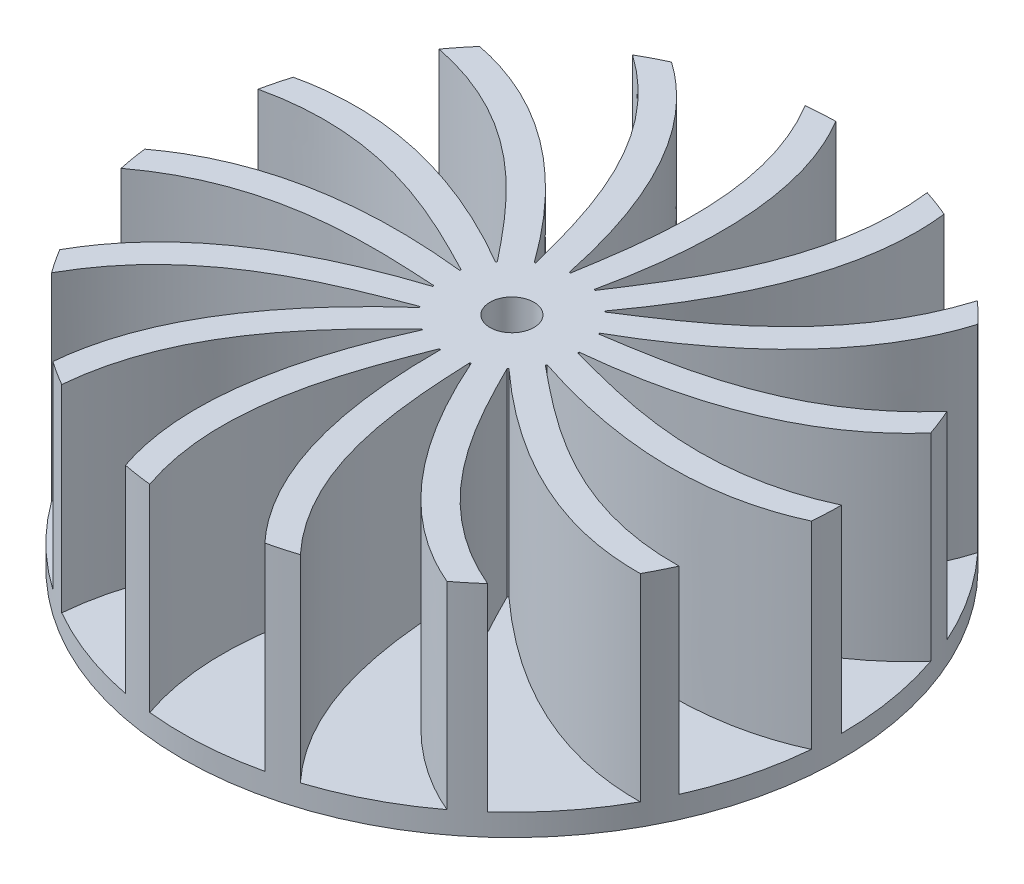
ISO-10303-21;
HEADER;
FILE_DESCRIPTION(('STEP AP214'),'2;1');
FILE_NAME('part.step','',(''),(''),'','','');
FILE_SCHEMA(('AUTOMOTIVE_DESIGN { 1 0 10303 214 1 1 1 1 }'));
ENDSEC;
DATA;
#1=APPLICATION_CONTEXT('core data for automotive mechanical design processes');
#2=APPLICATION_PROTOCOL_DEFINITION('international standard','automotive_design',2000,#1);
#3=PRODUCT_CONTEXT('',#1,'mechanical');
#4=PRODUCT('Part','Part','',(#3));
#5=PRODUCT_RELATED_PRODUCT_CATEGORY('part','',(#4));
#6=PRODUCT_DEFINITION_FORMATION('','',#4);
#7=PRODUCT_DEFINITION_CONTEXT('part definition',#1,'design');
#8=PRODUCT_DEFINITION('design','',#6,#7);
#9=PRODUCT_DEFINITION_SHAPE('','',#8);
#10=(LENGTH_UNIT() NAMED_UNIT(*) SI_UNIT(.MILLI.,.METRE.));
#11=(NAMED_UNIT(*) PLANE_ANGLE_UNIT() SI_UNIT($,.RADIAN.));
#12=(NAMED_UNIT(*) SI_UNIT($,.STERADIAN.) SOLID_ANGLE_UNIT());
#13=UNCERTAINTY_MEASURE_WITH_UNIT(LENGTH_MEASURE(1.E-05),#10,'distance_accuracy_value','');
#14=(GEOMETRIC_REPRESENTATION_CONTEXT(3) GLOBAL_UNCERTAINTY_ASSIGNED_CONTEXT((#13)) GLOBAL_UNIT_ASSIGNED_CONTEXT((#10,
#11,#12)) REPRESENTATION_CONTEXT('',''));
#15=CARTESIAN_POINT('',(0.,0.,0.));
#16=DIRECTION('',(0.,0.,1.));
#17=DIRECTION('',(1.,0.,0.));
#18=AXIS2_PLACEMENT_3D('',#15,#16,#17);
#19=CARTESIAN_POINT('',(0.,1.,0.));
#20=DIRECTION('',(0.,1.,0.));
#21=DIRECTION('',(0.,0.,1.));
#22=AXIS2_PLACEMENT_3D('',#19,#20,#21);
#23=PLANE('',#22);
#24=CARTESIAN_POINT('',(0.,1.,0.));
#25=DIRECTION('',(0.,1.,0.));
#26=DIRECTION('',(0.,0.,1.));
#27=AXIS2_PLACEMENT_3D('',#24,#25,#26);
#28=CIRCLE('',#27,3.);
#29=CARTESIAN_POINT('',(2.74063637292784,1.,-1.22020992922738));
#30=VERTEX_POINT('',#29);
#31=CARTESIAN_POINT('',(2.71563361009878,1.,-1.27488591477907));
#32=VERTEX_POINT('',#31);
#33=EDGE_CURVE('E53',#30,#32,#28,.T.);
#34=ORIENTED_EDGE('',*,*,#33,.F.);
#35=CARTESIAN_POINT('',(13.7031818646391,1.,-6.10104964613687));
#36=CARTESIAN_POINT('',(10.437337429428,1.,-2.35465238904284));
#37=CARTESIAN_POINT('',(5.85732627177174,1.,-1.70114399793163));
#38=CARTESIAN_POINT('',(2.74063637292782,1.,-1.2202099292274));
#39=B_SPLINE_CURVE_WITH_KNOTS('',3,(#35,#36,#37,#38),.UNSPECIFIED.,.F.,.F.,(4,4),(0.,1.),.UNSPECIFIED.);
#40=CARTESIAN_POINT('',(13.7031818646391,1.,-6.10104964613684));
#41=VERTEX_POINT('',#40);
#42=EDGE_CURVE('E427',#41,#30,#39,.T.);
#43=ORIENTED_EDGE('',*,*,#42,.F.);
#44=CARTESIAN_POINT('',(0.,1.,0.));
#45=DIRECTION('',(0.,1.,0.));
#46=DIRECTION('',(0.,0.,1.));
#47=AXIS2_PLACEMENT_3D('',#44,#45,#46);
#48=CIRCLE('',#47,15.);
#49=CARTESIAN_POINT('',(10.9734497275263,1.,-10.2266026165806));
#50=VERTEX_POINT('',#49);
#51=EDGE_CURVE('E439',#41,#50,#48,.T.);
#52=ORIENTED_EDGE('',*,*,#51,.T.);
#53=CARTESIAN_POINT('',(2.71563361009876,1.,-1.27488591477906));
#54=CARTESIAN_POINT('',(9.39491065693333,1.,-5.08897885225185));
#55=CARTESIAN_POINT('',(10.9734497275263,1.,-10.2266026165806));
#56=B_SPLINE_CURVE_WITH_KNOTS('',2,(#53,#54,#55),.UNSPECIFIED.,.F.,.F.,(3,3),(0.,1.),.UNSPECIFIED.);
#57=EDGE_CURVE('E1108',#32,#50,#56,.T.);
#58=ORIENTED_EDGE('',*,*,#57,.F.);
#59=EDGE_LOOP('',(#34,#43,#52,#58));
#60=FACE_BOUND('',#59,.T.);
#61=ADVANCED_FACE('F43',(#60),#23,.T.);
#62=CARTESIAN_POINT('',(15.,1.,0.));
#63=VERTEX_POINT('',#62);
#64=CARTESIAN_POINT('',(14.1842791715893,1.,-4.87916226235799));
#65=VERTEX_POINT('',#64);
#66=EDGE_CURVE('E451',#63,#65,#48,.T.);
#67=ORIENTED_EDGE('',*,*,#66,.T.);
#68=CARTESIAN_POINT('',(2.99939756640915,1.,-0.0601185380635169));
#69=CARTESIAN_POINT('',(10.6525521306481,1.,-0.827759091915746));
#70=CARTESIAN_POINT('',(14.1842791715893,1.,-4.87916226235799));
#71=B_SPLINE_CURVE_WITH_KNOTS('',2,(#68,#69,#70),.UNSPECIFIED.,.F.,.F.,(3,3),(0.,1.),.UNSPECIFIED.);
#72=CARTESIAN_POINT('',(2.99939756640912,1.,-0.0601185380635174));
#73=VERTEX_POINT('',#72);
#74=EDGE_CURVE('E442',#73,#65,#71,.T.);
#75=ORIENTED_EDGE('',*,*,#74,.F.);
#76=CARTESIAN_POINT('',(3.,1.,0.));
#77=VERTEX_POINT('',#76);
#78=EDGE_CURVE('E11',#77,#73,#28,.T.);
#79=ORIENTED_EDGE('',*,*,#78,.F.);
#80=CARTESIAN_POINT('',(15.,1.,0.));
#81=CARTESIAN_POINT('',(10.4927056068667,1.,2.09416559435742));
#82=CARTESIAN_POINT('',(6.04285140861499,1.,0.828316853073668));
#83=CARTESIAN_POINT('',(3.,1.,0.));
#84=B_SPLINE_CURVE_WITH_KNOTS('',3,(#80,#81,#82,#83),.UNSPECIFIED.,.F.,.F.,(4,4),(0.,1.),.UNSPECIFIED.);
#85=EDGE_CURVE('E488',#63,#77,#84,.T.);
#86=ORIENTED_EDGE('',*,*,#85,.F.);
#87=EDGE_LOOP('',(#67,#75,#79,#86));
#88=FACE_BOUND('',#87,.T.);
#89=ADVANCED_FACE('F552',(#88),#23,.T.);
#90=CARTESIAN_POINT('',(0.,10.,0.));
#91=DIRECTION('',(0.,-1.,0.));
#92=DIRECTION('',(0.,0.,-1.));
#93=AXIS2_PLACEMENT_3D('',#90,#91,#92);
#94=CYLINDRICAL_SURFACE('',#93,3.);
#95=DIRECTION('',(0.,-1.,0.));
#96=VECTOR('',#95,1.);
#97=CARTESIAN_POINT('',(2.74063637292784,10.,-1.22020992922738));
#98=LINE('',#97,#96);
#99=CARTESIAN_POINT('',(2.74063637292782,10.,-1.22020992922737));
#100=VERTEX_POINT('',#99);
#101=EDGE_CURVE('E62',#100,#30,#98,.T.);
#102=ORIENTED_EDGE('',*,*,#101,.T.);
#103=ORIENTED_EDGE('',*,*,#33,.T.);
#104=DIRECTION('',(0.,-1.,0.));
#105=VECTOR('',#104,1.);
#106=CARTESIAN_POINT('',(2.71563361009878,10.,-1.27488591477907));
#107=LINE('',#106,#105);
#108=CARTESIAN_POINT('',(2.71563361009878,10.,-1.27488591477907));
#109=VERTEX_POINT('',#108);
#110=EDGE_CURVE('E1125',#109,#32,#107,.T.);
#111=ORIENTED_EDGE('',*,*,#110,.F.);
#112=CARTESIAN_POINT('',(0.,10.,0.));
#113=DIRECTION('',(0.,1.,0.));
#114=DIRECTION('',(0.,0.,1.));
#115=AXIS2_PLACEMENT_3D('',#112,#113,#114);
#116=CIRCLE('',#115,3.);
#117=EDGE_CURVE('E463',#100,#109,#116,.T.);
#118=ORIENTED_EDGE('',*,*,#117,.F.);
#119=EDGE_LOOP('',(#102,#103,#111,#118));
#120=FACE_BOUND('',#119,.T.);
#121=ADVANCED_FACE('F539',(#120),#94,.T.);
#122=DIRECTION('',(0.,-1.,0.));
#123=VECTOR('',#122,1.);
#124=CARTESIAN_POINT('',(2.99939756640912,10.,-0.0601185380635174));
#125=LINE('',#124,#123);
#126=CARTESIAN_POINT('',(2.99939756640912,10.,-0.0601185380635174));
#127=VERTEX_POINT('',#126);
#128=EDGE_CURVE('E1143',#127,#73,#125,.T.);
#129=ORIENTED_EDGE('',*,*,#128,.F.);
#130=CARTESIAN_POINT('',(3.,10.,0.));
#131=VERTEX_POINT('',#130);
#132=EDGE_CURVE('E459',#131,#127,#116,.T.);
#133=ORIENTED_EDGE('',*,*,#132,.F.);
#134=DIRECTION('',(0.,-1.,0.));
#135=VECTOR('',#134,1.);
#136=CARTESIAN_POINT('',(3.,10.,0.));
#137=LINE('',#136,#135);
#138=EDGE_CURVE('E465',#131,#77,#137,.T.);
#139=ORIENTED_EDGE('',*,*,#138,.T.);
#140=ORIENTED_EDGE('',*,*,#78,.T.);
#141=EDGE_LOOP('',(#129,#133,#139,#140));
#142=FACE_BOUND('',#141,.T.);
#143=ADVANCED_FACE('F561',(#142),#94,.T.);
#144=CARTESIAN_POINT('',(2.00739181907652,1.,-2.22943447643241));
#145=VERTEX_POINT('',#144);
#146=CARTESIAN_POINT('',(1.96231193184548,1.,-2.26921393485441));
#147=VERTEX_POINT('',#146);
#148=EDGE_CURVE('E1523',#145,#147,#28,.T.);
#149=ORIENTED_EDGE('',*,*,#148,.F.);
#150=CARTESIAN_POINT('',(10.036959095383,1.,-11.1471723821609));
#151=CARTESIAN_POINT('',(8.57725879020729,1.,-6.39632958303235));
#152=CARTESIAN_POINT('',(4.65901621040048,1.,-3.93646159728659));
#153=CARTESIAN_POINT('',(2.00739181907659,1.,-2.22943447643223));
#154=B_SPLINE_CURVE_WITH_KNOTS('',3,(#150,#151,#152,#153),.UNSPECIFIED.,.F.,.F.,(4,4),(0.,1.),.UNSPECIFIED.);
#155=CARTESIAN_POINT('',(10.036959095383,1.,-11.1471723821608));
#156=VERTEX_POINT('',#155);
#157=EDGE_CURVE('E1105',#156,#145,#154,.T.);
#158=ORIENTED_EDGE('',*,*,#157,.F.);
#159=CARTESIAN_POINT('',(5.8652111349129,1.,-13.8057704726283));
#160=VERTEX_POINT('',#159);
#161=EDGE_CURVE('E452',#156,#160,#48,.T.);
#162=ORIENTED_EDGE('',*,*,#161,.T.);
#163=CARTESIAN_POINT('',(1.96231193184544,1.,-2.26921393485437));
#164=CARTESIAN_POINT('',(6.51280378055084,1.,-8.47026793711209));
#165=CARTESIAN_POINT('',(5.8652111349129,1.,-13.8057704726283));
#166=B_SPLINE_CURVE_WITH_KNOTS('',2,(#163,#164,#165),.UNSPECIFIED.,.F.,.F.,(3,3),(0.,1.),.UNSPECIFIED.);
#167=EDGE_CURVE('E1076',#147,#160,#166,.T.);
#168=ORIENTED_EDGE('',*,*,#167,.F.);
#169=EDGE_LOOP('',(#149,#158,#162,#168));
#170=FACE_BOUND('',#169,.T.);
#171=ADVANCED_FACE('F557',(#170),#23,.T.);
#172=DIRECTION('',(0.,-1.,0.));
#173=VECTOR('',#172,1.);
#174=CARTESIAN_POINT('',(2.00739181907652,10.,-2.22943447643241));
#175=LINE('',#174,#173);
#176=CARTESIAN_POINT('',(2.00739181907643,10.,-2.22943447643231));
#177=VERTEX_POINT('',#176);
#178=EDGE_CURVE('E70',#177,#145,#175,.T.);
#179=ORIENTED_EDGE('',*,*,#178,.T.);
#180=ORIENTED_EDGE('',*,*,#148,.T.);
#181=DIRECTION('',(0.,-1.,0.));
#182=VECTOR('',#181,1.);
#183=CARTESIAN_POINT('',(1.96231193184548,10.,-2.26921393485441));
#184=LINE('',#183,#182);
#185=CARTESIAN_POINT('',(1.96231193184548,10.,-2.26921393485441));
#186=VERTEX_POINT('',#185);
#187=EDGE_CURVE('E1097',#186,#147,#184,.T.);
#188=ORIENTED_EDGE('',*,*,#187,.F.);
#189=EDGE_CURVE('E705',#177,#186,#116,.T.);
#190=ORIENTED_EDGE('',*,*,#189,.F.);
#191=EDGE_LOOP('',(#179,#180,#188,#190));
#192=FACE_BOUND('',#191,.T.);
#193=ADVANCED_FACE('F564',(#192),#94,.T.);
#194=CARTESIAN_POINT('',(0.927050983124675,1.,-2.85316954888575));
#195=VERTEX_POINT('',#194);
#196=CARTESIAN_POINT('',(0.869688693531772,1.,-2.8711742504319));
#197=VERTEX_POINT('',#196);
#198=EDGE_CURVE('E1521',#195,#197,#28,.T.);
#199=ORIENTED_EDGE('',*,*,#198,.F.);
#200=CARTESIAN_POINT('',(4.63525491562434,1.,-14.2658477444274));
#201=CARTESIAN_POINT('',(5.23409418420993,1.,-9.33202328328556));
#202=CARTESIAN_POINT('',(2.65511992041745,1.,-5.49112922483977));
#203=CARTESIAN_POINT('',(0.927050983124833,1.,-2.85316954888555));
#204=B_SPLINE_CURVE_WITH_KNOTS('',3,(#200,#201,#202,#203),.UNSPECIFIED.,.F.,.F.,(4,4),(0.,1.),.UNSPECIFIED.);
#205=CARTESIAN_POINT('',(4.63525491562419,1.,-14.2658477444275));
#206=VERTEX_POINT('',#205);
#207=EDGE_CURVE('E1073',#206,#195,#204,.T.);
#208=ORIENTED_EDGE('',*,*,#207,.F.);
#209=CARTESIAN_POINT('',(-0.257175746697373,1.,-14.9977951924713));
#210=VERTEX_POINT('',#209);
#211=EDGE_CURVE('E457',#206,#210,#48,.T.);
#212=ORIENTED_EDGE('',*,*,#211,.T.);
#213=CARTESIAN_POINT('',(0.869688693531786,1.,-2.87117425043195));
#214=CARTESIAN_POINT('',(2.50457396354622,1.,-10.3869707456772));
#215=CARTESIAN_POINT('',(-0.257175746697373,1.,-14.9977951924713));
#216=B_SPLINE_CURVE_WITH_KNOTS('',2,(#213,#214,#215),.UNSPECIFIED.,.F.,.F.,(3,3),(0.,1.),.UNSPECIFIED.);
#217=EDGE_CURVE('E1044',#197,#210,#216,.T.);
#218=ORIENTED_EDGE('',*,*,#217,.F.);
#219=EDGE_LOOP('',(#199,#208,#212,#218));
#220=FACE_BOUND('',#219,.T.);
#221=ADVANCED_FACE('F566',(#220),#23,.T.);
#222=DIRECTION('',(0.,-1.,0.));
#223=VECTOR('',#222,1.);
#224=CARTESIAN_POINT('',(0.927050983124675,10.,-2.85316954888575));
#225=LINE('',#224,#223);
#226=CARTESIAN_POINT('',(0.927050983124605,10.,-2.85316954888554));
#227=VERTEX_POINT('',#226);
#228=EDGE_CURVE('E1101',#227,#195,#225,.T.);
#229=ORIENTED_EDGE('',*,*,#228,.T.);
#230=ORIENTED_EDGE('',*,*,#198,.T.);
#231=DIRECTION('',(0.,-1.,0.));
#232=VECTOR('',#231,1.);
#233=CARTESIAN_POINT('',(0.869688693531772,10.,-2.8711742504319));
#234=LINE('',#233,#232);
#235=CARTESIAN_POINT('',(0.869688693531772,10.,-2.8711742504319));
#236=VERTEX_POINT('',#235);
#237=EDGE_CURVE('E1065',#236,#197,#234,.T.);
#238=ORIENTED_EDGE('',*,*,#237,.F.);
#239=EDGE_CURVE('E707',#227,#236,#116,.T.);
#240=ORIENTED_EDGE('',*,*,#239,.F.);
#241=EDGE_LOOP('',(#229,#230,#238,#240));
#242=FACE_BOUND('',#241,.T.);
#243=ADVANCED_FACE('F572',(#242),#94,.T.);
#244=CARTESIAN_POINT('',(-0.313585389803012,1.,-2.98356568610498));
#245=VERTEX_POINT('',#244);
#246=CARTESIAN_POINT('',(-0.373311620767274,1.,-2.9766824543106));
#247=VERTEX_POINT('',#246);
#248=EDGE_CURVE('E1524',#245,#247,#28,.T.);
#249=ORIENTED_EDGE('',*,*,#248,.F.);
#250=CARTESIAN_POINT('',(-1.56792694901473,1.,-14.9178284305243));
#251=CARTESIAN_POINT('',(0.985907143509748,1.,-10.6541253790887));
#252=CARTESIAN_POINT('',(0.192129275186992,1.,-6.09633072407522));
#253=CARTESIAN_POINT('',(-0.313585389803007,1.,-2.98356568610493));
#254=B_SPLINE_CURVE_WITH_KNOTS('',3,(#250,#251,#252,#253),.UNSPECIFIED.,.F.,.F.,(4,4),(0.,1.),.UNSPECIFIED.);
#255=CARTESIAN_POINT('',(-1.56792694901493,1.,-14.9178284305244));
#256=VERTEX_POINT('',#255);
#257=EDGE_CURVE('E1041',#256,#245,#254,.T.);
#258=ORIENTED_EDGE('',*,*,#257,.F.);
#259=CARTESIAN_POINT('',(-6.33509460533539,1.,-13.596564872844));
#260=VERTEX_POINT('',#259);
#261=EDGE_CURVE('E1499',#256,#260,#48,.T.);
#262=ORIENTED_EDGE('',*,*,#261,.T.);
#263=CARTESIAN_POINT('',(-0.373311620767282,1.,-2.97668245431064));
#264=CARTESIAN_POINT('',(-1.93671944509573,1.,-10.5076719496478));
#265=CARTESIAN_POINT('',(-6.33509460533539,1.,-13.596564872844));
#266=B_SPLINE_CURVE_WITH_KNOTS('',2,(#263,#264,#265),.UNSPECIFIED.,.F.,.F.,(3,3),(0.,1.),.UNSPECIFIED.);
#267=EDGE_CURVE('E1012',#247,#260,#266,.T.);
#268=ORIENTED_EDGE('',*,*,#267,.F.);
#269=EDGE_LOOP('',(#249,#258,#262,#268));
#270=FACE_BOUND('',#269,.T.);
#271=ADVANCED_FACE('F577',(#270),#23,.T.);
#272=DIRECTION('',(0.,-1.,0.));
#273=VECTOR('',#272,1.);
#274=CARTESIAN_POINT('',(-0.313585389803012,10.,-2.98356568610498));
#275=LINE('',#274,#273);
#276=CARTESIAN_POINT('',(-0.313585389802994,10.,-2.98356568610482));
#277=VERTEX_POINT('',#276);
#278=EDGE_CURVE('E1069',#277,#245,#275,.T.);
#279=ORIENTED_EDGE('',*,*,#278,.T.);
#280=ORIENTED_EDGE('',*,*,#248,.T.);
#281=DIRECTION('',(0.,-1.,0.));
#282=VECTOR('',#281,1.);
#283=CARTESIAN_POINT('',(-0.373311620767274,10.,-2.9766824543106));
#284=LINE('',#283,#282);
#285=CARTESIAN_POINT('',(-0.373311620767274,10.,-2.9766824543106));
#286=VERTEX_POINT('',#285);
#287=EDGE_CURVE('E1033',#286,#247,#284,.T.);
#288=ORIENTED_EDGE('',*,*,#287,.F.);
#289=EDGE_CURVE('E709',#277,#286,#116,.T.);
#290=ORIENTED_EDGE('',*,*,#289,.F.);
#291=EDGE_LOOP('',(#279,#280,#288,#290));
#292=FACE_BOUND('',#291,.T.);
#293=ADVANCED_FACE('F582',(#292),#94,.T.);
#294=CARTESIAN_POINT('',(-1.50000000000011,1.,-2.59807621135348));
#295=VERTEX_POINT('',#294);
#296=CARTESIAN_POINT('',(-1.55176296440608,1.,-2.56749521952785));
#297=VERTEX_POINT('',#296);
#298=EDGE_CURVE('E1527',#295,#297,#28,.T.);
#299=ORIENTED_EDGE('',*,*,#298,.F.);
#300=CARTESIAN_POINT('',(-7.50000000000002,1.,-12.9903810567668));
#301=CARTESIAN_POINT('',(-3.4327521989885,1.,-10.1340324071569));
#302=CARTESIAN_POINT('',(-2.30408226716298,1.,-5.64742125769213));
#303=CARTESIAN_POINT('',(-1.50000000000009,1.,-2.59807621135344));
#304=B_SPLINE_CURVE_WITH_KNOTS('',3,(#300,#301,#302,#303),.UNSPECIFIED.,.F.,.F.,(4,4),(0.,1.),.UNSPECIFIED.);
#305=CARTESIAN_POINT('',(-7.5,1.,-12.9903810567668));
#306=VERTEX_POINT('',#305);
#307=EDGE_CURVE('E1009',#306,#295,#304,.T.);
#308=ORIENTED_EDGE('',*,*,#307,.F.);
#309=CARTESIAN_POINT('',(-11.3176180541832,1.,-9.84436496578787));
#310=VERTEX_POINT('',#309);
#311=EDGE_CURVE('E1494',#306,#310,#48,.T.);
#312=ORIENTED_EDGE('',*,*,#311,.T.);
#313=CARTESIAN_POINT('',(-1.55176296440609,1.,-2.56749521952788));
#314=CARTESIAN_POINT('',(-6.04313646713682,1.,-8.81150121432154));
#315=CARTESIAN_POINT('',(-11.3176180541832,1.,-9.84436496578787));
#316=B_SPLINE_CURVE_WITH_KNOTS('',2,(#313,#314,#315),.UNSPECIFIED.,.F.,.F.,(3,3),(0.,1.),.UNSPECIFIED.);
#317=EDGE_CURVE('E980',#297,#310,#316,.T.);
#318=ORIENTED_EDGE('',*,*,#317,.F.);
#319=EDGE_LOOP('',(#299,#308,#312,#318));
#320=FACE_BOUND('',#319,.T.);
#321=ADVANCED_FACE('F586',(#320),#23,.T.);
#322=DIRECTION('',(0.,-1.,0.));
#323=VECTOR('',#322,1.);
#324=CARTESIAN_POINT('',(-1.50000000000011,10.,-2.59807621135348));
#325=LINE('',#324,#323);
#326=CARTESIAN_POINT('',(-1.50000000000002,10.,-2.59807621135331));
#327=VERTEX_POINT('',#326);
#328=EDGE_CURVE('E1037',#327,#295,#325,.T.);
#329=ORIENTED_EDGE('',*,*,#328,.T.);
#330=ORIENTED_EDGE('',*,*,#298,.T.);
#331=DIRECTION('',(0.,-1.,0.));
#332=VECTOR('',#331,1.);
#333=CARTESIAN_POINT('',(-1.55176296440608,10.,-2.56749521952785));
#334=LINE('',#333,#332);
#335=CARTESIAN_POINT('',(-1.55176296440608,10.,-2.56749521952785));
#336=VERTEX_POINT('',#335);
#337=EDGE_CURVE('E1001',#336,#297,#334,.T.);
#338=ORIENTED_EDGE('',*,*,#337,.F.);
#339=EDGE_CURVE('E711',#327,#336,#116,.T.);
#340=ORIENTED_EDGE('',*,*,#339,.F.);
#341=EDGE_LOOP('',(#329,#330,#338,#340));
#342=FACE_BOUND('',#341,.T.);
#343=ADVANCED_FACE('F591',(#342),#94,.T.);
#344=CARTESIAN_POINT('',(-2.427050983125,1.,-1.76335575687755));
#345=VERTEX_POINT('',#344);
#346=CARTESIAN_POINT('',(-2.46190039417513,1.,-1.71436473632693));
#347=VERTEX_POINT('',#346);
#348=EDGE_CURVE('E1530',#345,#347,#28,.T.);
#349=ORIENTED_EDGE('',*,*,#348,.F.);
#350=CARTESIAN_POINT('',(-12.1352549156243,1.,-8.8167787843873));
#351=CARTESIAN_POINT('',(-7.25785750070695,1.,-7.86167316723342));
#352=CARTESIAN_POINT('',(-4.40189705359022,1.,-4.22202135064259));
#353=CARTESIAN_POINT('',(-2.42705098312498,1.,-1.76335575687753));
#354=B_SPLINE_CURVE_WITH_KNOTS('',3,(#350,#351,#352,#353),.UNSPECIFIED.,.F.,.F.,(4,4),(0.,1.),.UNSPECIFIED.);
#355=CARTESIAN_POINT('',(-12.1352549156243,1.,-8.8167787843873));
#356=VERTEX_POINT('',#355);
#357=EDGE_CURVE('E977',#356,#345,#354,.T.);
#358=ORIENTED_EDGE('',*,*,#357,.F.);
#359=CARTESIAN_POINT('',(-14.3432225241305,1.,-4.38998492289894));
#360=VERTEX_POINT('',#359);
#361=EDGE_CURVE('E1489',#356,#360,#48,.T.);
#362=ORIENTED_EDGE('',*,*,#361,.T.);
#363=CARTESIAN_POINT('',(-2.46190039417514,1.,-1.71436473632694));
#364=CARTESIAN_POINT('',(-9.10464029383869,1.,-5.59174186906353));
#365=CARTESIAN_POINT('',(-14.3432225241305,1.,-4.38998492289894));
#366=B_SPLINE_CURVE_WITH_KNOTS('',2,(#363,#364,#365),.UNSPECIFIED.,.F.,.F.,(3,3),(0.,1.),.UNSPECIFIED.);
#367=EDGE_CURVE('E948',#347,#360,#366,.T.);
#368=ORIENTED_EDGE('',*,*,#367,.F.);
#369=EDGE_LOOP('',(#349,#358,#362,#368));
#370=FACE_BOUND('',#369,.T.);
#371=ADVANCED_FACE('F595',(#370),#23,.T.);
#372=DIRECTION('',(0.,-1.,0.));
#373=VECTOR('',#372,1.);
#374=CARTESIAN_POINT('',(-2.427050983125,10.,-1.76335575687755));
#375=LINE('',#374,#373);
#376=CARTESIAN_POINT('',(-2.42705098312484,10.,-1.76335575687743));
#377=VERTEX_POINT('',#376);
#378=EDGE_CURVE('E1005',#377,#345,#375,.T.);
#379=ORIENTED_EDGE('',*,*,#378,.T.);
#380=ORIENTED_EDGE('',*,*,#348,.T.);
#381=DIRECTION('',(0.,-1.,0.));
#382=VECTOR('',#381,1.);
#383=CARTESIAN_POINT('',(-2.46190039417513,10.,-1.71436473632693));
#384=LINE('',#383,#382);
#385=CARTESIAN_POINT('',(-2.46190039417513,10.,-1.71436473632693));
#386=VERTEX_POINT('',#385);
#387=EDGE_CURVE('E969',#386,#347,#384,.T.);
#388=ORIENTED_EDGE('',*,*,#387,.F.);
#389=EDGE_CURVE('E713',#377,#386,#116,.T.);
#390=ORIENTED_EDGE('',*,*,#389,.F.);
#391=EDGE_LOOP('',(#379,#380,#388,#390));
#392=FACE_BOUND('',#391,.T.);
#393=ADVANCED_FACE('F600',(#392),#94,.T.);
#394=CARTESIAN_POINT('',(-2.9344428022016,1.,-0.62373507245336));
#395=VERTEX_POINT('',#394);
#396=CARTESIAN_POINT('',(-2.94635288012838,1.,-0.56480501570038));
#397=VERTEX_POINT('',#396);
#398=EDGE_CURVE('E1533',#395,#397,#28,.T.);
#399=ORIENTED_EDGE('',*,*,#398,.F.);
#400=CARTESIAN_POINT('',(-14.6722140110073,1.,-3.11867536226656));
#401=CARTESIAN_POINT('',(-9.82801330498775,1.,-4.22995921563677));
#402=CARTESIAN_POINT('',(-5.73858384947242,1.,-2.06659559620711));
#403=CARTESIAN_POINT('',(-2.93444280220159,1.,-0.623735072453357));
#404=B_SPLINE_CURVE_WITH_KNOTS('',3,(#400,#401,#402,#403),.UNSPECIFIED.,.F.,.F.,(4,4),(0.,1.),.UNSPECIFIED.);
#405=CARTESIAN_POINT('',(-14.6722140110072,1.,-3.11867536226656));
#406=VERTEX_POINT('',#405);
#407=EDGE_CURVE('E945',#406,#395,#404,.T.);
#408=ORIENTED_EDGE('',*,*,#407,.F.);
#409=CARTESIAN_POINT('',(-14.8887535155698,1.,1.8234633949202));
#410=VERTEX_POINT('',#409);
#411=EDGE_CURVE('E1484',#406,#410,#48,.T.);
#412=ORIENTED_EDGE('',*,*,#411,.T.);
#413=CARTESIAN_POINT('',(-2.94635288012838,1.,-0.564805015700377));
#414=CARTESIAN_POINT('',(-10.5918691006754,1.,-1.40511955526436));
#415=CARTESIAN_POINT('',(-14.8887535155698,1.,1.8234633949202));
#416=B_SPLINE_CURVE_WITH_KNOTS('',2,(#413,#414,#415),.UNSPECIFIED.,.F.,.F.,(3,3),(0.,1.),.UNSPECIFIED.);
#417=EDGE_CURVE('E916',#397,#410,#416,.T.);
#418=ORIENTED_EDGE('',*,*,#417,.F.);
#419=EDGE_LOOP('',(#399,#408,#412,#418));
#420=FACE_BOUND('',#419,.T.);
#421=ADVANCED_FACE('F604',(#420),#23,.T.);
#422=DIRECTION('',(0.,-1.,0.));
#423=VECTOR('',#422,1.);
#424=CARTESIAN_POINT('',(-2.9344428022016,10.,-0.62373507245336));
#425=LINE('',#424,#423);
#426=CARTESIAN_POINT('',(-2.93444280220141,10.,-0.623735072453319));
#427=VERTEX_POINT('',#426);
#428=EDGE_CURVE('E973',#427,#395,#425,.T.);
#429=ORIENTED_EDGE('',*,*,#428,.T.);
#430=ORIENTED_EDGE('',*,*,#398,.T.);
#431=DIRECTION('',(0.,-1.,0.));
#432=VECTOR('',#431,1.);
#433=CARTESIAN_POINT('',(-2.94635288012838,10.,-0.56480501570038));
#434=LINE('',#433,#432);
#435=CARTESIAN_POINT('',(-2.94635288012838,10.,-0.56480501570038));
#436=VERTEX_POINT('',#435);
#437=EDGE_CURVE('E937',#436,#397,#434,.T.);
#438=ORIENTED_EDGE('',*,*,#437,.F.);
#439=EDGE_CURVE('E715',#427,#436,#116,.T.);
#440=ORIENTED_EDGE('',*,*,#439,.F.);
#441=EDGE_LOOP('',(#429,#430,#438,#440));
#442=FACE_BOUND('',#441,.T.);
#443=ADVANCED_FACE('F609',(#442),#94,.T.);
#444=CARTESIAN_POINT('',(-2.9344428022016,1.,0.623735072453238));
#445=VERTEX_POINT('',#444);
#446=CARTESIAN_POINT('',(-2.92135418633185,1.,0.682414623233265));
#447=VERTEX_POINT('',#446);
#448=EDGE_CURVE('E1536',#445,#447,#28,.T.);
#449=ORIENTED_EDGE('',*,*,#448,.F.);
#450=CARTESIAN_POINT('',(-14.6722140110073,1.,3.11867536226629));
#451=CARTESIAN_POINT('',(-10.6988163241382,1.,0.133153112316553));
#452=CARTESIAN_POINT('',(-6.08301736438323,1.,0.446163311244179));
#453=CARTESIAN_POINT('',(-2.9344428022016,1.,0.62373507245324));
#454=B_SPLINE_CURVE_WITH_KNOTS('',3,(#450,#451,#452,#453),.UNSPECIFIED.,.F.,.F.,(4,4),(0.,1.),.UNSPECIFIED.);
#455=CARTESIAN_POINT('',(-14.6722140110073,1.,3.11867536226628));
#456=VERTEX_POINT('',#455);
#457=EDGE_CURVE('E913',#456,#445,#454,.T.);
#458=ORIENTED_EDGE('',*,*,#457,.F.);
#459=CARTESIAN_POINT('',(-12.8598837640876,1.,7.72161832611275));
#460=VERTEX_POINT('',#459);
#461=EDGE_CURVE('E1479',#456,#460,#48,.T.);
#462=ORIENTED_EDGE('',*,*,#461,.T.);
#463=CARTESIAN_POINT('',(-2.92135418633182,1.,0.68241462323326));
#464=CARTESIAN_POINT('',(-10.2476675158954,1.,3.02446069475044));
#465=CARTESIAN_POINT('',(-12.8598837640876,1.,7.72161832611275));
#466=B_SPLINE_CURVE_WITH_KNOTS('',2,(#463,#464,#465),.UNSPECIFIED.,.F.,.F.,(3,3),(0.,1.),.UNSPECIFIED.);
#467=EDGE_CURVE('E884',#447,#460,#466,.T.);
#468=ORIENTED_EDGE('',*,*,#467,.F.);
#469=EDGE_LOOP('',(#449,#458,#462,#468));
#470=FACE_BOUND('',#469,.T.);
#471=ADVANCED_FACE('F613',(#470),#23,.T.);
#472=DIRECTION('',(0.,-1.,0.));
#473=VECTOR('',#472,1.);
#474=CARTESIAN_POINT('',(-2.9344428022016,10.,0.623735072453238));
#475=LINE('',#474,#473);
#476=CARTESIAN_POINT('',(-2.93444280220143,10.,0.623735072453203));
#477=VERTEX_POINT('',#476);
#478=EDGE_CURVE('E941',#477,#445,#475,.T.);
#479=ORIENTED_EDGE('',*,*,#478,.T.);
#480=ORIENTED_EDGE('',*,*,#448,.T.);
#481=DIRECTION('',(0.,-1.,0.));
#482=VECTOR('',#481,1.);
#483=CARTESIAN_POINT('',(-2.92135418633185,10.,0.682414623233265));
#484=LINE('',#483,#482);
#485=CARTESIAN_POINT('',(-2.92135418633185,10.,0.682414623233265));
#486=VERTEX_POINT('',#485);
#487=EDGE_CURVE('E905',#486,#447,#484,.T.);
#488=ORIENTED_EDGE('',*,*,#487,.F.);
#489=EDGE_CURVE('E717',#477,#486,#116,.T.);
#490=ORIENTED_EDGE('',*,*,#489,.F.);
#491=EDGE_LOOP('',(#479,#480,#488,#490));
#492=FACE_BOUND('',#491,.T.);
#493=ADVANCED_FACE('F618',(#492),#94,.T.);
#494=CARTESIAN_POINT('',(-2.42705098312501,1.,1.76335575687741));
#495=VERTEX_POINT('',#494);
#496=CARTESIAN_POINT('',(-2.39122681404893,1.,1.81163857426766));
#497=VERTEX_POINT('',#496);
#498=EDGE_CURVE('E1539',#495,#497,#28,.T.);
#499=ORIENTED_EDGE('',*,*,#498,.F.);
#500=CARTESIAN_POINT('',(-12.1352549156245,1.,8.81677878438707));
#501=CARTESIAN_POINT('',(-9.71969680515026,1.,4.4732420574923));
#502=CARTESIAN_POINT('',(-5.37564191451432,1.,2.88177652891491));
#503=CARTESIAN_POINT('',(-2.42705098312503,1.,1.76335575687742));
#504=B_SPLINE_CURVE_WITH_KNOTS('',3,(#500,#501,#502,#503),.UNSPECIFIED.,.F.,.F.,(4,4),(0.,1.),.UNSPECIFIED.);
#505=CARTESIAN_POINT('',(-12.1352549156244,1.,8.81677878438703));
#506=VERTEX_POINT('',#505);
#507=EDGE_CURVE('E881',#506,#495,#504,.T.);
#508=ORIENTED_EDGE('',*,*,#507,.F.);
#509=CARTESIAN_POINT('',(-8.60742328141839,1.,12.2846353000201));
#510=VERTEX_POINT('',#509);
#511=EDGE_CURVE('E1474',#506,#510,#48,.T.);
#512=ORIENTED_EDGE('',*,*,#511,.T.);
#513=CARTESIAN_POINT('',(-2.3912268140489,1.,1.81163857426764));
#514=CARTESIAN_POINT('',(-8.13155112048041,1.,6.93108421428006));
#515=CARTESIAN_POINT('',(-8.60742328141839,1.,12.2846353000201));
#516=B_SPLINE_CURVE_WITH_KNOTS('',2,(#513,#514,#515),.UNSPECIFIED.,.F.,.F.,(3,3),(0.,1.),.UNSPECIFIED.);
#517=EDGE_CURVE('E852',#497,#510,#516,.T.);
#518=ORIENTED_EDGE('',*,*,#517,.F.);
#519=EDGE_LOOP('',(#499,#508,#512,#518));
#520=FACE_BOUND('',#519,.T.);
#521=ADVANCED_FACE('F622',(#520),#23,.T.);
#522=DIRECTION('',(0.,-1.,0.));
#523=VECTOR('',#522,1.);
#524=CARTESIAN_POINT('',(-2.42705098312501,10.,1.76335575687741));
#525=LINE('',#524,#523);
#526=CARTESIAN_POINT('',(-2.4270509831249,10.,1.76335575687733));
#527=VERTEX_POINT('',#526);
#528=EDGE_CURVE('E909',#527,#495,#525,.T.);
#529=ORIENTED_EDGE('',*,*,#528,.T.);
#530=ORIENTED_EDGE('',*,*,#498,.T.);
#531=DIRECTION('',(0.,-1.,0.));
#532=VECTOR('',#531,1.);
#533=CARTESIAN_POINT('',(-2.39122681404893,10.,1.81163857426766));
#534=LINE('',#533,#532);
#535=CARTESIAN_POINT('',(-2.39122681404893,10.,1.81163857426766));
#536=VERTEX_POINT('',#535);
#537=EDGE_CURVE('E873',#536,#497,#534,.T.);
#538=ORIENTED_EDGE('',*,*,#537,.F.);
#539=EDGE_CURVE('E719',#527,#536,#116,.T.);
#540=ORIENTED_EDGE('',*,*,#539,.F.);
#541=EDGE_LOOP('',(#529,#530,#538,#540));
#542=FACE_BOUND('',#541,.T.);
#543=ADVANCED_FACE('F627',(#542),#94,.T.);
#544=CARTESIAN_POINT('',(-1.50000000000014,1.,2.59807621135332));
#545=VERTEX_POINT('',#544);
#546=CARTESIAN_POINT('',(-1.44763460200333,1.,2.62761375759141));
#547=VERTEX_POINT('',#546);
#548=EDGE_CURVE('E1542',#545,#547,#28,.T.);
#549=ORIENTED_EDGE('',*,*,#548,.F.);
#550=CARTESIAN_POINT('',(-7.50000000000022,1.,12.9903810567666));
#551=CARTESIAN_POINT('',(-7.05995340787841,1.,8.03986681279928));
#552=CARTESIAN_POINT('',(-3.73876914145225,1.,4.81910440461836));
#553=CARTESIAN_POINT('',(-1.50000000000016,1.,2.59807621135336));
#554=B_SPLINE_CURVE_WITH_KNOTS('',3,(#550,#551,#552,#553),.UNSPECIFIED.,.F.,.F.,(4,4),(0.,1.),.UNSPECIFIED.);
#555=CARTESIAN_POINT('',(-7.50000000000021,1.,12.9903810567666));
#556=VERTEX_POINT('',#555);
#557=EDGE_CURVE('E849',#556,#545,#554,.T.);
#558=ORIENTED_EDGE('',*,*,#557,.F.);
#559=CARTESIAN_POINT('',(-2.86666111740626,1.,14.7235272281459));
#560=VERTEX_POINT('',#559);
#561=EDGE_CURVE('E1469',#556,#560,#48,.T.);
#562=ORIENTED_EDGE('',*,*,#561,.T.);
#563=CARTESIAN_POINT('',(-1.44763460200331,1.,2.62761375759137));
#564=CARTESIAN_POINT('',(-4.60941566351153,1.,9.6392603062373));
#565=CARTESIAN_POINT('',(-2.86666111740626,1.,14.7235272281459));
#566=B_SPLINE_CURVE_WITH_KNOTS('',2,(#563,#564,#565),.UNSPECIFIED.,.F.,.F.,(3,3),(0.,1.),.UNSPECIFIED.);
#567=EDGE_CURVE('E820',#547,#560,#566,.T.);
#568=ORIENTED_EDGE('',*,*,#567,.F.);
#569=EDGE_LOOP('',(#549,#558,#562,#568));
#570=FACE_BOUND('',#569,.T.);
#571=ADVANCED_FACE('F631',(#570),#23,.T.);
#572=DIRECTION('',(0.,-1.,0.));
#573=VECTOR('',#572,1.);
#574=CARTESIAN_POINT('',(-1.50000000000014,10.,2.59807621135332));
#575=LINE('',#574,#573);
#576=CARTESIAN_POINT('',(-1.5000000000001,10.,2.59807621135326));
#577=VERTEX_POINT('',#576);
#578=EDGE_CURVE('E877',#577,#545,#575,.T.);
#579=ORIENTED_EDGE('',*,*,#578,.T.);
#580=ORIENTED_EDGE('',*,*,#548,.T.);
#581=DIRECTION('',(0.,-1.,0.));
#582=VECTOR('',#581,1.);
#583=CARTESIAN_POINT('',(-1.44763460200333,10.,2.62761375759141));
#584=LINE('',#583,#582);
#585=CARTESIAN_POINT('',(-1.44763460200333,10.,2.62761375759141));
#586=VERTEX_POINT('',#585);
#587=EDGE_CURVE('E841',#586,#547,#584,.T.);
#588=ORIENTED_EDGE('',*,*,#587,.F.);
#589=EDGE_CURVE('E721',#577,#586,#116,.T.);
#590=ORIENTED_EDGE('',*,*,#589,.F.);
#591=EDGE_LOOP('',(#579,#580,#588,#590));
#592=FACE_BOUND('',#591,.T.);
#593=ADVANCED_FACE('F636',(#592),#94,.T.);
#594=CARTESIAN_POINT('',(-0.313585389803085,1.,2.98356568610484));
#595=VERTEX_POINT('',#594);
#596=CARTESIAN_POINT('',(-0.253733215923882,1.,2.98925065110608));
#597=VERTEX_POINT('',#596);
#598=EDGE_CURVE('E684',#595,#597,#28,.T.);
#599=ORIENTED_EDGE('',*,*,#598,.F.);
#600=CARTESIAN_POINT('',(-1.56792694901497,1.,14.9178284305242));
#601=CARTESIAN_POINT('',(-3.1794799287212,1.,10.2163255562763));
#602=CARTESIAN_POINT('',(-1.45542921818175,1.,5.9231653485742));
#603=CARTESIAN_POINT('',(-0.31358538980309,1.,2.98356568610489));
#604=B_SPLINE_CURVE_WITH_KNOTS('',3,(#600,#601,#602,#603),.UNSPECIFIED.,.F.,.F.,(4,4),(0.,1.),.UNSPECIFIED.);
#605=CARTESIAN_POINT('',(-1.56792694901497,1.,14.9178284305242));
#606=VERTEX_POINT('',#605);
#607=EDGE_CURVE('E817',#606,#595,#604,.T.);
#608=ORIENTED_EDGE('',*,*,#607,.F.);
#609=CARTESIAN_POINT('',(3.36977279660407,1.,14.6165875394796));
#610=VERTEX_POINT('',#609);
#611=EDGE_CURVE('E1467',#606,#610,#48,.T.);
#612=ORIENTED_EDGE('',*,*,#611,.T.);
#613=CARTESIAN_POINT('',(-0.253733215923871,1.,2.98925065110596));
#614=CARTESIAN_POINT('',(-0.290270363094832,1.,10.6807207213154));
#615=CARTESIAN_POINT('',(3.36977279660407,1.,14.6165875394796));
#616=B_SPLINE_CURVE_WITH_KNOTS('',2,(#613,#614,#615),.UNSPECIFIED.,.F.,.F.,(3,3),(0.,1.),.UNSPECIFIED.);
#617=EDGE_CURVE('E788',#597,#610,#616,.T.);
#618=ORIENTED_EDGE('',*,*,#617,.F.);
#619=EDGE_LOOP('',(#599,#608,#612,#618));
#620=FACE_BOUND('',#619,.T.);
#621=ADVANCED_FACE('F640',(#620),#23,.T.);
#622=DIRECTION('',(0.,-1.,0.));
#623=VECTOR('',#622,1.);
#624=CARTESIAN_POINT('',(-0.313585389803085,10.,2.98356568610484));
#625=LINE('',#624,#623);
#626=CARTESIAN_POINT('',(-0.313585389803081,10.,2.98356568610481));
#627=VERTEX_POINT('',#626);
#628=EDGE_CURVE('E845',#627,#595,#625,.T.);
#629=ORIENTED_EDGE('',*,*,#628,.T.);
#630=ORIENTED_EDGE('',*,*,#598,.T.);
#631=DIRECTION('',(0.,-1.,0.));
#632=VECTOR('',#631,1.);
#633=CARTESIAN_POINT('',(-0.253733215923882,10.,2.98925065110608));
#634=LINE('',#633,#632);
#635=CARTESIAN_POINT('',(-0.253733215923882,10.,2.98925065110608));
#636=VERTEX_POINT('',#635);
#637=EDGE_CURVE('E809',#636,#597,#634,.T.);
#638=ORIENTED_EDGE('',*,*,#637,.F.);
#639=EDGE_CURVE('E723',#627,#636,#116,.T.);
#640=ORIENTED_EDGE('',*,*,#639,.F.);
#641=EDGE_LOOP('',(#629,#630,#638,#640));
#642=FACE_BOUND('',#641,.T.);
#643=ADVANCED_FACE('F645',(#642),#94,.T.);
#644=CARTESIAN_POINT('',(0.927050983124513,1.,2.85316954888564));
#645=VERTEX_POINT('',#644);
#646=CARTESIAN_POINT('',(0.984040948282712,1.,2.83401895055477));
#647=VERTEX_POINT('',#646);
#648=EDGE_CURVE('E681',#645,#647,#28,.T.);
#649=ORIENTED_EDGE('',*,*,#648,.F.);
#650=CARTESIAN_POINT('',(4.63525491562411,1.,14.2658477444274));
#651=CARTESIAN_POINT('',(1.25075451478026,1.,10.6262887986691));
#652=CARTESIAN_POINT('',(1.07956763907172,1.,6.00305719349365));
#653=CARTESIAN_POINT('',(0.927050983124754,1.,2.85316954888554));
#654=B_SPLINE_CURVE_WITH_KNOTS('',3,(#650,#651,#652,#653),.UNSPECIFIED.,.F.,.F.,(4,4),(0.,1.),.UNSPECIFIED.);
#655=CARTESIAN_POINT('',(4.63525491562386,1.,14.2658477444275));
#656=VERTEX_POINT('',#655);
#657=EDGE_CURVE('E785',#656,#645,#654,.T.);
#658=ORIENTED_EDGE('',*,*,#657,.F.);
#659=CARTESIAN_POINT('',(9.02354238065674,1.,11.982307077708));
#660=VERTEX_POINT('',#659);
#661=EDGE_CURVE('E700',#656,#660,#48,.T.);
#662=ORIENTED_EDGE('',*,*,#661,.T.);
#663=CARTESIAN_POINT('',(0.98404094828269,1.,2.8340189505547));
#664=CARTESIAN_POINT('',(4.07906532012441,1.,9.87538749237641));
#665=CARTESIAN_POINT('',(9.02354238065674,1.,11.982307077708));
#666=B_SPLINE_CURVE_WITH_KNOTS('',2,(#663,#664,#665),.UNSPECIFIED.,.F.,.F.,(3,3),(0.,1.),.UNSPECIFIED.);
#667=EDGE_CURVE('E757',#647,#660,#666,.T.);
#668=ORIENTED_EDGE('',*,*,#667,.F.);
#669=EDGE_LOOP('',(#649,#658,#662,#668));
#670=FACE_BOUND('',#669,.T.);
#671=ADVANCED_FACE('F649',(#670),#23,.T.);
#672=DIRECTION('',(0.,-1.,0.));
#673=VECTOR('',#672,1.);
#674=CARTESIAN_POINT('',(0.927050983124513,10.,2.85316954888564));
#675=LINE('',#674,#673);
#676=CARTESIAN_POINT('',(0.927050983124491,10.,2.85316954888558));
#677=VERTEX_POINT('',#676);
#678=EDGE_CURVE('E813',#677,#645,#675,.T.);
#679=ORIENTED_EDGE('',*,*,#678,.T.);
#680=ORIENTED_EDGE('',*,*,#648,.T.);
#681=DIRECTION('',(0.,-1.,0.));
#682=VECTOR('',#681,1.);
#683=CARTESIAN_POINT('',(0.984040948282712,10.,2.83401895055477));
#684=LINE('',#683,#682);
#685=CARTESIAN_POINT('',(0.984040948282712,10.,2.83401895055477));
#686=VERTEX_POINT('',#685);
#687=EDGE_CURVE('E778',#686,#647,#684,.T.);
#688=ORIENTED_EDGE('',*,*,#687,.F.);
#689=EDGE_CURVE('E725',#677,#686,#116,.T.);
#690=ORIENTED_EDGE('',*,*,#689,.F.);
#691=EDGE_LOOP('',(#679,#680,#688,#690));
#692=FACE_BOUND('',#691,.T.);
#693=ADVANCED_FACE('F654',(#692),#94,.T.);
#694=CARTESIAN_POINT('',(2.00739181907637,1.,2.22943447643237));
#695=VERTEX_POINT('',#694);
#696=CARTESIAN_POINT('',(2.0516654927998,1.,2.18875962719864));
#697=VERTEX_POINT('',#696);
#698=EDGE_CURVE('E672',#695,#697,#28,.T.);
#699=ORIENTED_EDGE('',*,*,#698,.F.);
#700=CARTESIAN_POINT('',(10.0369590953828,1.,11.147172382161));
#701=CARTESIAN_POINT('',(5.46472213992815,1.,9.19887017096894));
#702=CARTESIAN_POINT('',(3.42789744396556,1.,5.04496591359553));
#703=CARTESIAN_POINT('',(2.00739181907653,1.,2.22943447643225));
#704=B_SPLINE_CURVE_WITH_KNOTS('',3,(#700,#701,#702,#703),.UNSPECIFIED.,.F.,.F.,(4,4),(0.,1.),.UNSPECIFIED.);
#705=CARTESIAN_POINT('',(10.0369590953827,1.,11.1471723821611));
#706=VERTEX_POINT('',#705);
#707=EDGE_CURVE('E673',#706,#695,#704,.T.);
#708=ORIENTED_EDGE('',*,*,#707,.F.);
#709=CARTESIAN_POINT('',(13.1170595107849,1.,7.27617686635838));
#710=VERTEX_POINT('',#709);
#711=EDGE_CURVE('E697',#706,#710,#48,.T.);
#712=ORIENTED_EDGE('',*,*,#711,.T.);
#713=CARTESIAN_POINT('',(2.05166549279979,1.,2.18875962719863));
#714=CARTESIAN_POINT('',(7.74309355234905,1.,7.36251005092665));
#715=CARTESIAN_POINT('',(13.1170595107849,1.,7.27617686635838));
#716=B_SPLINE_CURVE_WITH_KNOTS('',2,(#713,#714,#715),.UNSPECIFIED.,.F.,.F.,(3,3),(0.,1.),.UNSPECIFIED.);
#717=EDGE_CURVE('E676',#697,#710,#716,.T.);
#718=ORIENTED_EDGE('',*,*,#717,.F.);
#719=EDGE_LOOP('',(#699,#708,#712,#718));
#720=FACE_BOUND('',#719,.T.);
#721=ADVANCED_FACE('F543',(#720),#23,.T.);
#722=DIRECTION('',(0.,-1.,0.));
#723=VECTOR('',#722,1.);
#724=CARTESIAN_POINT('',(2.00739181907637,10.,2.22943447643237));
#725=LINE('',#724,#723);
#726=CARTESIAN_POINT('',(2.00739181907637,10.,2.22943447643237));
#727=VERTEX_POINT('',#726);
#728=EDGE_CURVE('E782',#727,#695,#725,.T.);
#729=ORIENTED_EDGE('',*,*,#728,.T.);
#730=ORIENTED_EDGE('',*,*,#698,.T.);
#731=DIRECTION('',(0.,-1.,0.));
#732=VECTOR('',#731,1.);
#733=CARTESIAN_POINT('',(2.0516654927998,10.,2.18875962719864));
#734=LINE('',#733,#732);
#735=CARTESIAN_POINT('',(2.0516654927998,10.,2.18875962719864));
#736=VERTEX_POINT('',#735);
#737=EDGE_CURVE('E750',#736,#697,#734,.T.);
#738=ORIENTED_EDGE('',*,*,#737,.F.);
#739=EDGE_CURVE('E727',#727,#736,#116,.T.);
#740=ORIENTED_EDGE('',*,*,#739,.F.);
#741=EDGE_LOOP('',(#729,#730,#738,#740));
#742=FACE_BOUND('',#741,.T.);
#743=ADVANCED_FACE('F540',(#742),#94,.T.);
#744=CARTESIAN_POINT('',(2.74063637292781,1.,1.22020992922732));
#745=VERTEX_POINT('',#744);
#746=CARTESIAN_POINT('',(2.76453843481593,1.,1.16504388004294));
#747=VERTEX_POINT('',#746);
#748=EDGE_CURVE('E55',#745,#747,#28,.T.);
#749=ORIENTED_EDGE('',*,*,#748,.F.);
#750=CARTESIAN_POINT('',(13.703181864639,1.,6.10104964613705));
#751=CARTESIAN_POINT('',(8.73378966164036,1.,6.18088332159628));
#752=CARTESIAN_POINT('',(5.18351263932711,1.,3.21455419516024));
#753=CARTESIAN_POINT('',(2.74063637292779,1.,1.22020992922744));
#754=B_SPLINE_CURVE_WITH_KNOTS('',3,(#750,#751,#752,#753),.UNSPECIFIED.,.F.,.F.,(4,4),(0.,1.),.UNSPECIFIED.);
#755=CARTESIAN_POINT('',(13.703181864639,1.,6.10104964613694));
#756=VERTEX_POINT('',#755);
#757=EDGE_CURVE('E496',#756,#745,#754,.T.);
#758=ORIENTED_EDGE('',*,*,#757,.F.);
#759=CARTESIAN_POINT('',(14.9425178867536,1.,1.31192957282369));
#760=VERTEX_POINT('',#759);
#761=EDGE_CURVE('E456',#756,#760,#48,.T.);
#762=ORIENTED_EDGE('',*,*,#761,.T.);
#763=CARTESIAN_POINT('',(2.76453843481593,1.,1.16504388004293));
#764=CARTESIAN_POINT('',(10.068270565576,1.,3.57658773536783));
#765=CARTESIAN_POINT('',(14.9425178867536,1.,1.31192957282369));
#766=B_SPLINE_CURVE_WITH_KNOTS('',2,(#763,#764,#765),.UNSPECIFIED.,.F.,.F.,(3,3),(0.,1.),.UNSPECIFIED.);
#767=EDGE_CURVE('E481',#747,#760,#766,.T.);
#768=ORIENTED_EDGE('',*,*,#767,.F.);
#769=EDGE_LOOP('',(#749,#758,#762,#768));
#770=FACE_BOUND('',#769,.T.);
#771=ADVANCED_FACE('F537',(#770),#23,.T.);
#772=DIRECTION('',(0.,-1.,0.));
#773=VECTOR('',#772,1.);
#774=CARTESIAN_POINT('',(2.74063637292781,10.,1.22020992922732));
#775=LINE('',#774,#773);
#776=CARTESIAN_POINT('',(2.74063637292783,10.,1.22020992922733));
#777=VERTEX_POINT('',#776);
#778=EDGE_CURVE('E689',#777,#745,#775,.T.);
#779=ORIENTED_EDGE('',*,*,#778,.T.);
#780=ORIENTED_EDGE('',*,*,#748,.T.);
#781=DIRECTION('',(0.,-1.,0.));
#782=VECTOR('',#781,1.);
#783=CARTESIAN_POINT('',(2.76453843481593,10.,1.16504388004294));
#784=LINE('',#783,#782);
#785=CARTESIAN_POINT('',(2.76453843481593,10.,1.16504388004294));
#786=VERTEX_POINT('',#785);
#787=EDGE_CURVE('E469',#786,#747,#784,.T.);
#788=ORIENTED_EDGE('',*,*,#787,.F.);
#789=EDGE_CURVE('E464',#777,#786,#116,.T.);
#790=ORIENTED_EDGE('',*,*,#789,.F.);
#791=EDGE_LOOP('',(#779,#780,#788,#790));
#792=FACE_BOUND('',#791,.T.);
#793=ADVANCED_FACE('F534',(#792),#94,.T.);
#794=CARTESIAN_POINT('',(0.,1.,0.));
#795=DIRECTION('',(0.,-1.,0.));
#796=DIRECTION('',(0.,0.,-1.));
#797=AXIS2_PLACEMENT_3D('',#794,#795,#796);
#798=CYLINDRICAL_SURFACE('',#797,15.);
#799=ORIENTED_EDGE('',*,*,#66,.F.);
#800=DIRECTION('',(0.,-1.,0.));
#801=VECTOR('',#800,1.);
#802=CARTESIAN_POINT('',(15.,10.,0.));
#803=LINE('',#802,#801);
#804=CARTESIAN_POINT('',(15.,10.,0.));
#805=VERTEX_POINT('',#804);
#806=EDGE_CURVE('E477',#805,#63,#803,.T.);
#807=ORIENTED_EDGE('',*,*,#806,.F.);
#808=CARTESIAN_POINT('',(-3.42129574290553E-13,10.,0.));
#809=DIRECTION('',(0.,1.,0.));
#810=DIRECTION('',(0.,0.,-1.));
#811=AXIS2_PLACEMENT_3D('',#808,#809,#810);
#812=CIRCLE('',#811,15.0000000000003);
#813=CARTESIAN_POINT('',(14.9425178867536,10.,1.31192957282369));
#814=VERTEX_POINT('',#813);
#815=EDGE_CURVE('E480',#814,#805,#812,.T.);
#816=ORIENTED_EDGE('',*,*,#815,.F.);
#817=DIRECTION('',(0.,-1.,0.));
#818=VECTOR('',#817,1.);
#819=CARTESIAN_POINT('',(14.9425178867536,10.,1.31192957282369));
#820=LINE('',#819,#818);
#821=EDGE_CURVE('E473',#814,#760,#820,.T.);
#822=ORIENTED_EDGE('',*,*,#821,.T.);
#823=ORIENTED_EDGE('',*,*,#761,.F.);
#824=DIRECTION('',(0.,-1.,0.));
#825=VECTOR('',#824,1.);
#826=CARTESIAN_POINT('',(13.703181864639,10.,6.10104964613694));
#827=LINE('',#826,#825);
#828=CARTESIAN_POINT('',(13.703181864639,10.,6.10104964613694));
#829=VERTEX_POINT('',#828);
#830=EDGE_CURVE('E743',#829,#756,#827,.T.);
#831=ORIENTED_EDGE('',*,*,#830,.F.);
#832=CARTESIAN_POINT('',(-3.42129574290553E-13,10.,0.));
#833=DIRECTION('',(0.,1.,0.));
#834=DIRECTION('',(0.,0.,-1.));
#835=AXIS2_PLACEMENT_3D('',#832,#833,#834);
#836=CIRCLE('',#835,15.0000000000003);
#837=CARTESIAN_POINT('',(13.1170595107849,10.,7.27617686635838));
#838=VERTEX_POINT('',#837);
#839=EDGE_CURVE('E741',#838,#829,#836,.T.);
#840=ORIENTED_EDGE('',*,*,#839,.F.);
#841=DIRECTION('',(0.,-1.,0.));
#842=VECTOR('',#841,1.);
#843=CARTESIAN_POINT('',(13.1170595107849,10.,7.27617686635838));
#844=LINE('',#843,#842);
#845=EDGE_CURVE('E746',#838,#710,#844,.T.);
#846=ORIENTED_EDGE('',*,*,#845,.T.);
#847=ORIENTED_EDGE('',*,*,#711,.F.);
#848=DIRECTION('',(0.,-1.,0.));
#849=VECTOR('',#848,1.);
#850=CARTESIAN_POINT('',(10.0369590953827,10.,11.1471723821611));
#851=LINE('',#850,#849);
#852=CARTESIAN_POINT('',(10.0369590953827,10.,11.1471723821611));
#853=VERTEX_POINT('',#852);
#854=EDGE_CURVE('E771',#853,#706,#851,.T.);
#855=ORIENTED_EDGE('',*,*,#854,.F.);
#856=CARTESIAN_POINT('',(-3.42129574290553E-13,10.,0.));
#857=DIRECTION('',(0.,1.,0.));
#858=DIRECTION('',(0.,0.,-1.));
#859=AXIS2_PLACEMENT_3D('',#856,#857,#858);
#860=CIRCLE('',#859,15.0000000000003);
#861=CARTESIAN_POINT('',(9.02354238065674,10.,11.982307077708));
#862=VERTEX_POINT('',#861);
#863=EDGE_CURVE('E768',#862,#853,#860,.T.);
#864=ORIENTED_EDGE('',*,*,#863,.F.);
#865=DIRECTION('',(0.,-1.,0.));
#866=VECTOR('',#865,1.);
#867=CARTESIAN_POINT('',(9.02354238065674,10.,11.982307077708));
#868=LINE('',#867,#866);
#869=EDGE_CURVE('E774',#862,#660,#868,.T.);
#870=ORIENTED_EDGE('',*,*,#869,.T.);
#871=ORIENTED_EDGE('',*,*,#661,.F.);
#872=DIRECTION('',(0.,-1.,0.));
#873=VECTOR('',#872,1.);
#874=CARTESIAN_POINT('',(4.63525491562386,10.,14.2658477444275));
#875=LINE('',#874,#873);
#876=CARTESIAN_POINT('',(4.63525491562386,10.,14.2658477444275));
#877=VERTEX_POINT('',#876);
#878=EDGE_CURVE('E802',#877,#656,#875,.T.);
#879=ORIENTED_EDGE('',*,*,#878,.F.);
#880=CARTESIAN_POINT('',(-3.42129574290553E-13,10.,0.));
#881=DIRECTION('',(0.,1.,0.));
#882=DIRECTION('',(0.,0.,-1.));
#883=AXIS2_PLACEMENT_3D('',#880,#881,#882);
#884=CIRCLE('',#883,15.0000000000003);
#885=CARTESIAN_POINT('',(3.36977279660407,10.,14.6165875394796));
#886=VERTEX_POINT('',#885);
#887=EDGE_CURVE('E799',#886,#877,#884,.T.);
#888=ORIENTED_EDGE('',*,*,#887,.F.);
#889=DIRECTION('',(0.,-1.,0.));
#890=VECTOR('',#889,1.);
#891=CARTESIAN_POINT('',(3.36977279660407,10.,14.6165875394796));
#892=LINE('',#891,#890);
#893=EDGE_CURVE('E805',#886,#610,#892,.T.);
#894=ORIENTED_EDGE('',*,*,#893,.T.);
#895=ORIENTED_EDGE('',*,*,#611,.F.);
#896=DIRECTION('',(0.,-1.,0.));
#897=VECTOR('',#896,1.);
#898=CARTESIAN_POINT('',(-1.56792694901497,10.,14.9178284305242));
#899=LINE('',#898,#897);
#900=CARTESIAN_POINT('',(-1.56792694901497,10.,14.9178284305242));
#901=VERTEX_POINT('',#900);
#902=EDGE_CURVE('E834',#901,#606,#899,.T.);
#903=ORIENTED_EDGE('',*,*,#902,.F.);
#904=CARTESIAN_POINT('',(-3.42129574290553E-13,10.,0.));
#905=DIRECTION('',(0.,1.,0.));
#906=DIRECTION('',(0.,0.,-1.));
#907=AXIS2_PLACEMENT_3D('',#904,#905,#906);
#908=CIRCLE('',#907,15.0000000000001);
#909=CARTESIAN_POINT('',(-2.86666111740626,10.,14.7235272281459));
#910=VERTEX_POINT('',#909);
#911=EDGE_CURVE('E831',#910,#901,#908,.T.);
#912=ORIENTED_EDGE('',*,*,#911,.F.);
#913=DIRECTION('',(0.,-1.,0.));
#914=VECTOR('',#913,1.);
#915=CARTESIAN_POINT('',(-2.86666111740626,10.,14.7235272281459));
#916=LINE('',#915,#914);
#917=EDGE_CURVE('E837',#910,#560,#916,.T.);
#918=ORIENTED_EDGE('',*,*,#917,.T.);
#919=ORIENTED_EDGE('',*,*,#561,.F.);
#920=DIRECTION('',(0.,-1.,0.));
#921=VECTOR('',#920,1.);
#922=CARTESIAN_POINT('',(-7.50000000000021,10.,12.9903810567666));
#923=LINE('',#922,#921);
#924=CARTESIAN_POINT('',(-7.50000000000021,10.,12.9903810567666));
#925=VERTEX_POINT('',#924);
#926=EDGE_CURVE('E866',#925,#556,#923,.T.);
#927=ORIENTED_EDGE('',*,*,#926,.F.);
#928=CARTESIAN_POINT('',(-3.42129574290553E-13,10.,0.));
#929=DIRECTION('',(0.,1.,0.));
#930=DIRECTION('',(0.,0.,-1.));
#931=AXIS2_PLACEMENT_3D('',#928,#929,#930);
#932=CIRCLE('',#931,15.);
#933=CARTESIAN_POINT('',(-8.60742328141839,10.,12.2846353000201));
#934=VERTEX_POINT('',#933);
#935=EDGE_CURVE('E863',#934,#925,#932,.T.);
#936=ORIENTED_EDGE('',*,*,#935,.F.);
#937=DIRECTION('',(0.,-1.,0.));
#938=VECTOR('',#937,1.);
#939=CARTESIAN_POINT('',(-8.60742328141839,10.,12.2846353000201));
#940=LINE('',#939,#938);
#941=EDGE_CURVE('E869',#934,#510,#940,.T.);
#942=ORIENTED_EDGE('',*,*,#941,.T.);
#943=ORIENTED_EDGE('',*,*,#511,.F.);
#944=DIRECTION('',(0.,-1.,0.));
#945=VECTOR('',#944,1.);
#946=CARTESIAN_POINT('',(-12.1352549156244,10.,8.81677878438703));
#947=LINE('',#946,#945);
#948=CARTESIAN_POINT('',(-12.1352549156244,10.,8.81677878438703));
#949=VERTEX_POINT('',#948);
#950=EDGE_CURVE('E898',#949,#506,#947,.T.);
#951=ORIENTED_EDGE('',*,*,#950,.F.);
#952=CARTESIAN_POINT('',(-3.42129574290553E-13,10.,0.));
#953=DIRECTION('',(0.,1.,0.));
#954=DIRECTION('',(0.,0.,-1.));
#955=AXIS2_PLACEMENT_3D('',#952,#953,#954);
#956=CIRCLE('',#955,14.9999999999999);
#957=CARTESIAN_POINT('',(-12.8598837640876,10.,7.72161832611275));
#958=VERTEX_POINT('',#957);
#959=EDGE_CURVE('E895',#958,#949,#956,.T.);
#960=ORIENTED_EDGE('',*,*,#959,.F.);
#961=DIRECTION('',(0.,-1.,0.));
#962=VECTOR('',#961,1.);
#963=CARTESIAN_POINT('',(-12.8598837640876,10.,7.72161832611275));
#964=LINE('',#963,#962);
#965=EDGE_CURVE('E901',#958,#460,#964,.T.);
#966=ORIENTED_EDGE('',*,*,#965,.T.);
#967=ORIENTED_EDGE('',*,*,#461,.F.);
#968=DIRECTION('',(0.,-1.,0.));
#969=VECTOR('',#968,1.);
#970=CARTESIAN_POINT('',(-14.6722140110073,10.,3.11867536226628));
#971=LINE('',#970,#969);
#972=CARTESIAN_POINT('',(-14.6722140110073,10.,3.11867536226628));
#973=VERTEX_POINT('',#972);
#974=EDGE_CURVE('E930',#973,#456,#971,.T.);
#975=ORIENTED_EDGE('',*,*,#974,.F.);
#976=CARTESIAN_POINT('',(-3.42129574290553E-13,10.,0.));
#977=DIRECTION('',(0.,1.,0.));
#978=DIRECTION('',(0.,0.,-1.));
#979=AXIS2_PLACEMENT_3D('',#976,#977,#978);
#980=CIRCLE('',#979,14.9999999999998);
#981=CARTESIAN_POINT('',(-14.8887535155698,10.,1.8234633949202));
#982=VERTEX_POINT('',#981);
#983=EDGE_CURVE('E927',#982,#973,#980,.T.);
#984=ORIENTED_EDGE('',*,*,#983,.F.);
#985=DIRECTION('',(0.,-1.,0.));
#986=VECTOR('',#985,1.);
#987=CARTESIAN_POINT('',(-14.8887535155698,10.,1.8234633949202));
#988=LINE('',#987,#986);
#989=EDGE_CURVE('E933',#982,#410,#988,.T.);
#990=ORIENTED_EDGE('',*,*,#989,.T.);
#991=ORIENTED_EDGE('',*,*,#411,.F.);
#992=DIRECTION('',(0.,-1.,0.));
#993=VECTOR('',#992,1.);
#994=CARTESIAN_POINT('',(-14.6722140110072,10.,-3.11867536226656));
#995=LINE('',#994,#993);
#996=CARTESIAN_POINT('',(-14.6722140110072,10.,-3.11867536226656));
#997=VERTEX_POINT('',#996);
#998=EDGE_CURVE('E962',#997,#406,#995,.T.);
#999=ORIENTED_EDGE('',*,*,#998,.F.);
#1000=CARTESIAN_POINT('',(-3.42129574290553E-13,10.,0.));
#1001=DIRECTION('',(0.,1.,0.));
#1002=DIRECTION('',(0.,0.,-1.));
#1003=AXIS2_PLACEMENT_3D('',#1000,#1001,#1002);
#1004=CIRCLE('',#1003,14.9999999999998);
#1005=CARTESIAN_POINT('',(-14.3432225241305,10.,-4.38998492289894));
#1006=VERTEX_POINT('',#1005);
#1007=EDGE_CURVE('E959',#1006,#997,#1004,.T.);
#1008=ORIENTED_EDGE('',*,*,#1007,.F.);
#1009=DIRECTION('',(0.,-1.,0.));
#1010=VECTOR('',#1009,1.);
#1011=CARTESIAN_POINT('',(-14.3432225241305,10.,-4.38998492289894));
#1012=LINE('',#1011,#1010);
#1013=EDGE_CURVE('E965',#1006,#360,#1012,.T.);
#1014=ORIENTED_EDGE('',*,*,#1013,.T.);
#1015=ORIENTED_EDGE('',*,*,#361,.F.);
#1016=DIRECTION('',(0.,-1.,0.));
#1017=VECTOR('',#1016,1.);
#1018=CARTESIAN_POINT('',(-12.1352549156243,10.,-8.8167787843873));
#1019=LINE('',#1018,#1017);
#1020=CARTESIAN_POINT('',(-12.1352549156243,10.,-8.8167787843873));
#1021=VERTEX_POINT('',#1020);
#1022=EDGE_CURVE('E994',#1021,#356,#1019,.T.);
#1023=ORIENTED_EDGE('',*,*,#1022,.F.);
#1024=CARTESIAN_POINT('',(-3.42129574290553E-13,10.,0.));
#1025=DIRECTION('',(0.,1.,0.));
#1026=DIRECTION('',(0.,0.,-1.));
#1027=AXIS2_PLACEMENT_3D('',#1024,#1025,#1026);
#1028=CIRCLE('',#1027,14.9999999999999);
#1029=CARTESIAN_POINT('',(-11.3176180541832,10.,-9.84436496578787));
#1030=VERTEX_POINT('',#1029);
#1031=EDGE_CURVE('E991',#1030,#1021,#1028,.T.);
#1032=ORIENTED_EDGE('',*,*,#1031,.F.);
#1033=DIRECTION('',(0.,-1.,0.));
#1034=VECTOR('',#1033,1.);
#1035=CARTESIAN_POINT('',(-11.3176180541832,10.,-9.84436496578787));
#1036=LINE('',#1035,#1034);
#1037=EDGE_CURVE('E997',#1030,#310,#1036,.T.);
#1038=ORIENTED_EDGE('',*,*,#1037,.T.);
#1039=ORIENTED_EDGE('',*,*,#311,.F.);
#1040=DIRECTION('',(0.,-1.,0.));
#1041=VECTOR('',#1040,1.);
#1042=CARTESIAN_POINT('',(-7.5,10.,-12.9903810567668));
#1043=LINE('',#1042,#1041);
#1044=CARTESIAN_POINT('',(-7.5,10.,-12.9903810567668));
#1045=VERTEX_POINT('',#1044);
#1046=EDGE_CURVE('E1026',#1045,#306,#1043,.T.);
#1047=ORIENTED_EDGE('',*,*,#1046,.F.);
#1048=CARTESIAN_POINT('',(-3.42129574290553E-13,10.,0.));
#1049=DIRECTION('',(0.,1.,0.));
#1050=DIRECTION('',(0.,0.,-1.));
#1051=AXIS2_PLACEMENT_3D('',#1048,#1049,#1050);
#1052=CIRCLE('',#1051,14.9999999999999);
#1053=CARTESIAN_POINT('',(-6.33509460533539,10.,-13.596564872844));
#1054=VERTEX_POINT('',#1053);
#1055=EDGE_CURVE('E1023',#1054,#1045,#1052,.T.);
#1056=ORIENTED_EDGE('',*,*,#1055,.F.);
#1057=DIRECTION('',(0.,-1.,0.));
#1058=VECTOR('',#1057,1.);
#1059=CARTESIAN_POINT('',(-6.33509460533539,10.,-13.596564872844));
#1060=LINE('',#1059,#1058);
#1061=EDGE_CURVE('E1029',#1054,#260,#1060,.T.);
#1062=ORIENTED_EDGE('',*,*,#1061,.T.);
#1063=ORIENTED_EDGE('',*,*,#261,.F.);
#1064=DIRECTION('',(0.,-1.,0.));
#1065=VECTOR('',#1064,1.);
#1066=CARTESIAN_POINT('',(-1.56792694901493,10.,-14.9178284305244));
#1067=LINE('',#1066,#1065);
#1068=CARTESIAN_POINT('',(-1.56792694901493,10.,-14.9178284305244));
#1069=VERTEX_POINT('',#1068);
#1070=EDGE_CURVE('E1058',#1069,#256,#1067,.T.);
#1071=ORIENTED_EDGE('',*,*,#1070,.F.);
#1072=CARTESIAN_POINT('',(-3.42129574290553E-13,10.,0.));
#1073=DIRECTION('',(0.,1.,0.));
#1074=DIRECTION('',(0.,0.,-1.));
#1075=AXIS2_PLACEMENT_3D('',#1072,#1073,#1074);
#1076=CIRCLE('',#1075,15.0000000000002);
#1077=CARTESIAN_POINT('',(-0.257175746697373,10.,-14.9977951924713));
#1078=VERTEX_POINT('',#1077);
#1079=EDGE_CURVE('E1055',#1078,#1069,#1076,.T.);
#1080=ORIENTED_EDGE('',*,*,#1079,.F.);
#1081=DIRECTION('',(0.,-1.,0.));
#1082=VECTOR('',#1081,1.);
#1083=CARTESIAN_POINT('',(-0.257175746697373,10.,-14.9977951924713));
#1084=LINE('',#1083,#1082);
#1085=EDGE_CURVE('E1061',#1078,#210,#1084,.T.);
#1086=ORIENTED_EDGE('',*,*,#1085,.T.);
#1087=ORIENTED_EDGE('',*,*,#211,.F.);
#1088=DIRECTION('',(0.,-1.,0.));
#1089=VECTOR('',#1088,1.);
#1090=CARTESIAN_POINT('',(4.63525491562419,10.,-14.2658477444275));
#1091=LINE('',#1090,#1089);
#1092=CARTESIAN_POINT('',(4.63525491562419,10.,-14.2658477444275));
#1093=VERTEX_POINT('',#1092);
#1094=EDGE_CURVE('E1090',#1093,#206,#1091,.T.);
#1095=ORIENTED_EDGE('',*,*,#1094,.F.);
#1096=CARTESIAN_POINT('',(-3.42129574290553E-13,10.,0.));
#1097=DIRECTION('',(0.,1.,0.));
#1098=DIRECTION('',(0.,0.,-1.));
#1099=AXIS2_PLACEMENT_3D('',#1096,#1097,#1098);
#1100=CIRCLE('',#1099,15.0000000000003);
#1101=CARTESIAN_POINT('',(5.8652111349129,10.,-13.8057704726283));
#1102=VERTEX_POINT('',#1101);
#1103=EDGE_CURVE('E1087',#1102,#1093,#1100,.T.);
#1104=ORIENTED_EDGE('',*,*,#1103,.F.);
#1105=DIRECTION('',(0.,-1.,0.));
#1106=VECTOR('',#1105,1.);
#1107=CARTESIAN_POINT('',(5.8652111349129,10.,-13.8057704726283));
#1108=LINE('',#1107,#1106);
#1109=EDGE_CURVE('E1093',#1102,#160,#1108,.T.);
#1110=ORIENTED_EDGE('',*,*,#1109,.T.);
#1111=ORIENTED_EDGE('',*,*,#161,.F.);
#1112=DIRECTION('',(0.,-1.,0.));
#1113=VECTOR('',#1112,1.);
#1114=CARTESIAN_POINT('',(10.036959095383,10.,-11.1471723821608));
#1115=LINE('',#1114,#1113);
#1116=CARTESIAN_POINT('',(10.036959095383,10.,-11.1471723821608));
#1117=VERTEX_POINT('',#1116);
#1118=EDGE_CURVE('E1120',#1117,#156,#1115,.T.);
#1119=ORIENTED_EDGE('',*,*,#1118,.F.);
#1120=CARTESIAN_POINT('',(-3.42129574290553E-13,10.,0.));
#1121=DIRECTION('',(0.,1.,0.));
#1122=DIRECTION('',(0.,0.,-1.));
#1123=AXIS2_PLACEMENT_3D('',#1120,#1121,#1122);
#1124=CIRCLE('',#1123,15.0000000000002);
#1125=CARTESIAN_POINT('',(10.9734497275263,10.,-10.2266026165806));
#1126=VERTEX_POINT('',#1125);
#1127=EDGE_CURVE('E1117',#1126,#1117,#1124,.T.);
#1128=ORIENTED_EDGE('',*,*,#1127,.F.);
#1129=DIRECTION('',(0.,-1.,0.));
#1130=VECTOR('',#1129,1.);
#1131=CARTESIAN_POINT('',(10.9734497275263,10.,-10.2266026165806));
#1132=LINE('',#1131,#1130);
#1133=EDGE_CURVE('E449',#1126,#50,#1132,.T.);
#1134=ORIENTED_EDGE('',*,*,#1133,.T.);
#1135=ORIENTED_EDGE('',*,*,#51,.F.);
#1136=DIRECTION('',(0.,-1.,0.));
#1137=VECTOR('',#1136,1.);
#1138=CARTESIAN_POINT('',(13.7031818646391,10.,-6.10104964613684));
#1139=LINE('',#1138,#1137);
#1140=CARTESIAN_POINT('',(13.7031818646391,10.,-6.10104964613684));
#1141=VERTEX_POINT('',#1140);
#1142=EDGE_CURVE('E424',#1141,#41,#1139,.T.);
#1143=ORIENTED_EDGE('',*,*,#1142,.F.);
#1144=CARTESIAN_POINT('',(-3.42129574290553E-13,10.,0.));
#1145=DIRECTION('',(0.,1.,0.));
#1146=DIRECTION('',(0.,0.,-1.));
#1147=AXIS2_PLACEMENT_3D('',#1144,#1145,#1146);
#1148=CIRCLE('',#1147,15.0000000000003);
#1149=CARTESIAN_POINT('',(14.1842791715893,10.,-4.87916226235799));
#1150=VERTEX_POINT('',#1149);
#1151=EDGE_CURVE('E433',#1150,#1141,#1148,.T.);
#1152=ORIENTED_EDGE('',*,*,#1151,.F.);
#1153=DIRECTION('',(0.,-1.,0.));
#1154=VECTOR('',#1153,1.);
#1155=CARTESIAN_POINT('',(14.1842791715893,10.,-4.87916226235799));
#1156=LINE('',#1155,#1154);
#1157=EDGE_CURVE('E434',#1150,#65,#1156,.T.);
#1158=ORIENTED_EDGE('',*,*,#1157,.T.);
#1159=EDGE_LOOP('',(#799,#807,#816,#822,#823,#831,#840,#846,#847,#855,#864,#870,#871,#879,#888,
#894,#895,#903,#912,#918,#919,#927,#936,#942,#943,#951,#960,#966,#967,#975,#984,#990,#991,#999,
#1008,#1014,#1015,#1023,#1032,#1038,#1039,#1047,#1056,#1062,#1063,#1071,#1080,#1086,#1087,#1095,
#1104,#1110,#1111,#1119,#1128,#1134,#1135,#1143,#1152,#1158));
#1160=FACE_BOUND('',#1159,.T.);
#1161=CARTESIAN_POINT('',(0.,0.,0.));
#1162=DIRECTION('',(0.,1.,0.));
#1163=DIRECTION('',(0.,0.,1.));
#1164=AXIS2_PLACEMENT_3D('',#1161,#1162,#1163);
#1165=CIRCLE('',#1164,15.);
#1166=CARTESIAN_POINT('',(0.,0.,15.));
#1167=VERTEX_POINT('',#1166);
#1168=EDGE_CURVE('E47',#1167,#1167,#1165,.T.);
#1169=ORIENTED_EDGE('',*,*,#1168,.T.);
#1170=EDGE_LOOP('',(#1169));
#1171=FACE_BOUND('',#1170,.T.);
#1172=ADVANCED_FACE('F45',(#1160,#1171),#798,.T.);
#1173=CARTESIAN_POINT('',(0.,0.,0.));
#1174=DIRECTION('',(0.,1.,0.));
#1175=DIRECTION('',(0.,0.,1.));
#1176=AXIS2_PLACEMENT_3D('',#1173,#1174,#1175);
#1177=PLANE('',#1176);
#1178=CARTESIAN_POINT('',(0.,0.,0.));
#1179=DIRECTION('',(0.,1.,0.));
#1180=DIRECTION('',(0.,0.,1.));
#1181=AXIS2_PLACEMENT_3D('',#1178,#1179,#1180);
#1182=CIRCLE('',#1181,1.);
#1183=CARTESIAN_POINT('',(0.,0.,1.));
#1184=VERTEX_POINT('',#1183);
#1185=EDGE_CURVE('E1148',#1184,#1184,#1182,.T.);
#1186=ORIENTED_EDGE('',*,*,#1185,.T.);
#1187=EDGE_LOOP('',(#1186));
#1188=FACE_BOUND('',#1187,.T.);
#1189=ORIENTED_EDGE('',*,*,#1168,.F.);
#1190=EDGE_LOOP('',(#1189));
#1191=FACE_BOUND('',#1190,.T.);
#1192=ADVANCED_FACE('F532',(#1188,#1191),#1177,.F.);
#1193=CARTESIAN_POINT('',(0.,10.,0.));
#1194=DIRECTION('',(0.,1.,0.));
#1195=DIRECTION('',(0.,0.,1.));
#1196=AXIS2_PLACEMENT_3D('',#1193,#1194,#1195);
#1197=PLANE('',#1196);
#1198=CARTESIAN_POINT('',(0.,10.,0.));
#1199=DIRECTION('',(0.,-1.,0.));
#1200=DIRECTION('',(0.,0.,-1.));
#1201=AXIS2_PLACEMENT_3D('',#1198,#1199,#1200);
#1202=CIRCLE('',#1201,1.);
#1203=CARTESIAN_POINT('',(0.,10.,-1.));
#1204=VERTEX_POINT('',#1203);
#1205=EDGE_CURVE('E1151',#1204,#1204,#1202,.T.);
#1206=ORIENTED_EDGE('',*,*,#1205,.T.);
#1207=EDGE_LOOP('',(#1206));
#1208=FACE_BOUND('',#1207,.T.);
#1209=ORIENTED_EDGE('',*,*,#132,.T.);
#1210=CARTESIAN_POINT('',(2.99939756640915,10.,-0.0601185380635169));
#1211=CARTESIAN_POINT('',(10.6525521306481,10.,-0.827759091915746));
#1212=CARTESIAN_POINT('',(14.1842791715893,10.,-4.87916226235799));
#1213=B_SPLINE_CURVE_WITH_KNOTS('',2,(#1210,#1211,#1212),.UNSPECIFIED.,.F.,.F.,(3,3),(0.,1.),.UNSPECIFIED.);
#1214=EDGE_CURVE('E1135',#127,#1150,#1213,.T.);
#1215=ORIENTED_EDGE('',*,*,#1214,.T.);
#1216=ORIENTED_EDGE('',*,*,#1151,.T.);
#1217=CARTESIAN_POINT('',(13.7031818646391,10.,-6.10104964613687));
#1218=CARTESIAN_POINT('',(10.437337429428,10.,-2.35465238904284));
#1219=CARTESIAN_POINT('',(5.85732627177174,10.,-1.70114399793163));
#1220=CARTESIAN_POINT('',(2.74063637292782,10.,-1.2202099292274));
#1221=B_SPLINE_CURVE_WITH_KNOTS('',3,(#1217,#1218,#1219,#1220),.UNSPECIFIED.,.F.,.F.,(4,4),(0.,
1.),.UNSPECIFIED.);
#1222=EDGE_CURVE('E428',#1141,#100,#1221,.T.);
#1223=ORIENTED_EDGE('',*,*,#1222,.T.);
#1224=ORIENTED_EDGE('',*,*,#117,.T.);
#1225=CARTESIAN_POINT('',(2.71563361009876,10.,-1.27488591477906));
#1226=CARTESIAN_POINT('',(9.39491065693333,10.,-5.08897885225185));
#1227=CARTESIAN_POINT('',(10.9734497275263,10.,-10.2266026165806));
#1228=B_SPLINE_CURVE_WITH_KNOTS('',2,(#1225,#1226,#1227),.UNSPECIFIED.,.F.,.F.,(3,3),(0.,1.),.UNSPECIFIED.);
#1229=EDGE_CURVE('E1114',#109,#1126,#1228,.T.);
#1230=ORIENTED_EDGE('',*,*,#1229,.T.);
#1231=ORIENTED_EDGE('',*,*,#1127,.T.);
#1232=CARTESIAN_POINT('',(10.036959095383,10.,-11.1471723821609));
#1233=CARTESIAN_POINT('',(8.57725879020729,10.,-6.39632958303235));
#1234=CARTESIAN_POINT('',(4.65901621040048,10.,-3.93646159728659));
#1235=CARTESIAN_POINT('',(2.00739181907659,10.,-2.22943447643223));
#1236=B_SPLINE_CURVE_WITH_KNOTS('',3,(#1232,#1233,#1234,#1235),.UNSPECIFIED.,.F.,.F.,(4,4),(0.,
1.),.UNSPECIFIED.);
#1237=EDGE_CURVE('E1111',#1117,#177,#1236,.T.);
#1238=ORIENTED_EDGE('',*,*,#1237,.T.);
#1239=ORIENTED_EDGE('',*,*,#189,.T.);
#1240=CARTESIAN_POINT('',(1.96231193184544,10.,-2.26921393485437));
#1241=CARTESIAN_POINT('',(6.51280378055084,10.,-8.47026793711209));
#1242=CARTESIAN_POINT('',(5.8652111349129,10.,-13.8057704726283));
#1243=B_SPLINE_CURVE_WITH_KNOTS('',2,(#1240,#1241,#1242),.UNSPECIFIED.,.F.,.F.,(3,3),(0.,1.),.UNSPECIFIED.);
#1244=EDGE_CURVE('E1084',#186,#1102,#1243,.T.);
#1245=ORIENTED_EDGE('',*,*,#1244,.T.);
#1246=ORIENTED_EDGE('',*,*,#1103,.T.);
#1247=CARTESIAN_POINT('',(4.63525491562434,10.,-14.2658477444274));
#1248=CARTESIAN_POINT('',(5.23409418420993,10.,-9.33202328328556));
#1249=CARTESIAN_POINT('',(2.65511992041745,10.,-5.49112922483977));
#1250=CARTESIAN_POINT('',(0.927050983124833,10.,-2.85316954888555));
#1251=B_SPLINE_CURVE_WITH_KNOTS('',3,(#1247,#1248,#1249,#1250),.UNSPECIFIED.,.F.,.F.,(4,4),(0.,
1.),.UNSPECIFIED.);
#1252=EDGE_CURVE('E1080',#1093,#227,#1251,.T.);
#1253=ORIENTED_EDGE('',*,*,#1252,.T.);
#1254=ORIENTED_EDGE('',*,*,#239,.T.);
#1255=CARTESIAN_POINT('',(0.869688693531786,10.,-2.87117425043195));
#1256=CARTESIAN_POINT('',(2.50457396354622,10.,-10.3869707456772));
#1257=CARTESIAN_POINT('',(-0.257175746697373,10.,-14.9977951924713));
#1258=B_SPLINE_CURVE_WITH_KNOTS('',2,(#1255,#1256,#1257),.UNSPECIFIED.,.F.,.F.,(3,3),(0.,1.),.UNSPECIFIED.);
#1259=EDGE_CURVE('E1052',#236,#1078,#1258,.T.);
#1260=ORIENTED_EDGE('',*,*,#1259,.T.);
#1261=ORIENTED_EDGE('',*,*,#1079,.T.);
#1262=CARTESIAN_POINT('',(-1.56792694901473,10.,-14.9178284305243));
#1263=CARTESIAN_POINT('',(0.985907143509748,10.,-10.6541253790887));
#1264=CARTESIAN_POINT('',(0.192129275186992,10.,-6.09633072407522));
#1265=CARTESIAN_POINT('',(-0.313585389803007,10.,-2.98356568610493));
#1266=B_SPLINE_CURVE_WITH_KNOTS('',3,(#1262,#1263,#1264,#1265),.UNSPECIFIED.,.F.,.F.,(4,4),(0.,
1.),.UNSPECIFIED.);
#1267=EDGE_CURVE('E1048',#1069,#277,#1266,.T.);
#1268=ORIENTED_EDGE('',*,*,#1267,.T.);
#1269=ORIENTED_EDGE('',*,*,#289,.T.);
#1270=CARTESIAN_POINT('',(-0.373311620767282,10.,-2.97668245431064));
#1271=CARTESIAN_POINT('',(-1.93671944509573,10.,-10.5076719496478));
#1272=CARTESIAN_POINT('',(-6.33509460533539,10.,-13.596564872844));
#1273=B_SPLINE_CURVE_WITH_KNOTS('',2,(#1270,#1271,#1272),.UNSPECIFIED.,.F.,.F.,(3,3),(0.,1.),.UNSPECIFIED.);
#1274=EDGE_CURVE('E1020',#286,#1054,#1273,.T.);
#1275=ORIENTED_EDGE('',*,*,#1274,.T.);
#1276=ORIENTED_EDGE('',*,*,#1055,.T.);
#1277=CARTESIAN_POINT('',(-7.50000000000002,10.,-12.9903810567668));
#1278=CARTESIAN_POINT('',(-3.4327521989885,10.,-10.1340324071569));
#1279=CARTESIAN_POINT('',(-2.30408226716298,10.,-5.64742125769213));
#1280=CARTESIAN_POINT('',(-1.50000000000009,10.,-2.59807621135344));
#1281=B_SPLINE_CURVE_WITH_KNOTS('',3,(#1277,#1278,#1279,#1280),.UNSPECIFIED.,.F.,.F.,(4,4),(0.,
1.),.UNSPECIFIED.);
#1282=EDGE_CURVE('E1016',#1045,#327,#1281,.T.);
#1283=ORIENTED_EDGE('',*,*,#1282,.T.);
#1284=ORIENTED_EDGE('',*,*,#339,.T.);
#1285=CARTESIAN_POINT('',(-1.55176296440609,10.,-2.56749521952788));
#1286=CARTESIAN_POINT('',(-6.04313646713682,10.,-8.81150121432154));
#1287=CARTESIAN_POINT('',(-11.3176180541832,10.,-9.84436496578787));
#1288=B_SPLINE_CURVE_WITH_KNOTS('',2,(#1285,#1286,#1287),.UNSPECIFIED.,.F.,.F.,(3,3),(0.,1.),.UNSPECIFIED.);
#1289=EDGE_CURVE('E988',#336,#1030,#1288,.T.);
#1290=ORIENTED_EDGE('',*,*,#1289,.T.);
#1291=ORIENTED_EDGE('',*,*,#1031,.T.);
#1292=CARTESIAN_POINT('',(-12.1352549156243,10.,-8.8167787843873));
#1293=CARTESIAN_POINT('',(-7.25785750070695,10.,-7.86167316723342));
#1294=CARTESIAN_POINT('',(-4.40189705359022,10.,-4.22202135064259));
#1295=CARTESIAN_POINT('',(-2.42705098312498,10.,-1.76335575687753));
#1296=B_SPLINE_CURVE_WITH_KNOTS('',3,(#1292,#1293,#1294,#1295),.UNSPECIFIED.,.F.,.F.,(4,4),(0.,
1.),.UNSPECIFIED.);
#1297=EDGE_CURVE('E984',#1021,#377,#1296,.T.);
#1298=ORIENTED_EDGE('',*,*,#1297,.T.);
#1299=ORIENTED_EDGE('',*,*,#389,.T.);
#1300=CARTESIAN_POINT('',(-2.46190039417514,10.,-1.71436473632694));
#1301=CARTESIAN_POINT('',(-9.10464029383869,10.,-5.59174186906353));
#1302=CARTESIAN_POINT('',(-14.3432225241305,10.,-4.38998492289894));
#1303=B_SPLINE_CURVE_WITH_KNOTS('',2,(#1300,#1301,#1302),.UNSPECIFIED.,.F.,.F.,(3,3),(0.,1.),.UNSPECIFIED.);
#1304=EDGE_CURVE('E956',#386,#1006,#1303,.T.);
#1305=ORIENTED_EDGE('',*,*,#1304,.T.);
#1306=ORIENTED_EDGE('',*,*,#1007,.T.);
#1307=CARTESIAN_POINT('',(-14.6722140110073,10.,-3.11867536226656));
#1308=CARTESIAN_POINT('',(-9.82801330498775,10.,-4.22995921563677));
#1309=CARTESIAN_POINT('',(-5.73858384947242,10.,-2.06659559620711));
#1310=CARTESIAN_POINT('',(-2.93444280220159,10.,-0.623735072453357));
#1311=B_SPLINE_CURVE_WITH_KNOTS('',3,(#1307,#1308,#1309,#1310),.UNSPECIFIED.,.F.,.F.,(4,4),(0.,
1.),.UNSPECIFIED.);
#1312=EDGE_CURVE('E952',#997,#427,#1311,.T.);
#1313=ORIENTED_EDGE('',*,*,#1312,.T.);
#1314=ORIENTED_EDGE('',*,*,#439,.T.);
#1315=CARTESIAN_POINT('',(-2.94635288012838,10.,-0.564805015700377));
#1316=CARTESIAN_POINT('',(-10.5918691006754,10.,-1.40511955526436));
#1317=CARTESIAN_POINT('',(-14.8887535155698,10.,1.8234633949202));
#1318=B_SPLINE_CURVE_WITH_KNOTS('',2,(#1315,#1316,#1317),.UNSPECIFIED.,.F.,.F.,(3,3),(0.,1.),.UNSPECIFIED.);
#1319=EDGE_CURVE('E924',#436,#982,#1318,.T.);
#1320=ORIENTED_EDGE('',*,*,#1319,.T.);
#1321=ORIENTED_EDGE('',*,*,#983,.T.);
#1322=CARTESIAN_POINT('',(-14.6722140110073,10.,3.11867536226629));
#1323=CARTESIAN_POINT('',(-10.6988163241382,10.,0.133153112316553));
#1324=CARTESIAN_POINT('',(-6.08301736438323,10.,0.446163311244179));
#1325=CARTESIAN_POINT('',(-2.9344428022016,10.,0.62373507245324));
#1326=B_SPLINE_CURVE_WITH_KNOTS('',3,(#1322,#1323,#1324,#1325),.UNSPECIFIED.,.F.,.F.,(4,4),(0.,
1.),.UNSPECIFIED.);
#1327=EDGE_CURVE('E920',#973,#477,#1326,.T.);
#1328=ORIENTED_EDGE('',*,*,#1327,.T.);
#1329=ORIENTED_EDGE('',*,*,#489,.T.);
#1330=CARTESIAN_POINT('',(-2.92135418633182,10.,0.68241462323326));
#1331=CARTESIAN_POINT('',(-10.2476675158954,10.,3.02446069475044));
#1332=CARTESIAN_POINT('',(-12.8598837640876,10.,7.72161832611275));
#1333=B_SPLINE_CURVE_WITH_KNOTS('',2,(#1330,#1331,#1332),.UNSPECIFIED.,.F.,.F.,(3,3),(0.,1.),.UNSPECIFIED.);
#1334=EDGE_CURVE('E892',#486,#958,#1333,.T.);
#1335=ORIENTED_EDGE('',*,*,#1334,.T.);
#1336=ORIENTED_EDGE('',*,*,#959,.T.);
#1337=CARTESIAN_POINT('',(-12.1352549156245,10.,8.81677878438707));
#1338=CARTESIAN_POINT('',(-9.71969680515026,10.,4.4732420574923));
#1339=CARTESIAN_POINT('',(-5.37564191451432,10.,2.88177652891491));
#1340=CARTESIAN_POINT('',(-2.42705098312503,10.,1.76335575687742));
#1341=B_SPLINE_CURVE_WITH_KNOTS('',3,(#1337,#1338,#1339,#1340),.UNSPECIFIED.,.F.,.F.,(4,4),(0.,
1.),.UNSPECIFIED.);
#1342=EDGE_CURVE('E888',#949,#527,#1341,.T.);
#1343=ORIENTED_EDGE('',*,*,#1342,.T.);
#1344=ORIENTED_EDGE('',*,*,#539,.T.);
#1345=CARTESIAN_POINT('',(-2.3912268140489,10.,1.81163857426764));
#1346=CARTESIAN_POINT('',(-8.13155112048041,10.,6.93108421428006));
#1347=CARTESIAN_POINT('',(-8.60742328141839,10.,12.2846353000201));
#1348=B_SPLINE_CURVE_WITH_KNOTS('',2,(#1345,#1346,#1347),.UNSPECIFIED.,.F.,.F.,(3,3),(0.,1.),.UNSPECIFIED.);
#1349=EDGE_CURVE('E860',#536,#934,#1348,.T.);
#1350=ORIENTED_EDGE('',*,*,#1349,.T.);
#1351=ORIENTED_EDGE('',*,*,#935,.T.);
#1352=CARTESIAN_POINT('',(-7.50000000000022,10.,12.9903810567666));
#1353=CARTESIAN_POINT('',(-7.05995340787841,10.,8.03986681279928));
#1354=CARTESIAN_POINT('',(-3.73876914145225,10.,4.81910440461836));
#1355=CARTESIAN_POINT('',(-1.50000000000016,10.,2.59807621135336));
#1356=B_SPLINE_CURVE_WITH_KNOTS('',3,(#1352,#1353,#1354,#1355),.UNSPECIFIED.,.F.,.F.,(4,4),(0.,
1.),.UNSPECIFIED.);
#1357=EDGE_CURVE('E856',#925,#577,#1356,.T.);
#1358=ORIENTED_EDGE('',*,*,#1357,.T.);
#1359=ORIENTED_EDGE('',*,*,#589,.T.);
#1360=CARTESIAN_POINT('',(-1.44763460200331,10.,2.62761375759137));
#1361=CARTESIAN_POINT('',(-4.60941566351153,10.,9.6392603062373));
#1362=CARTESIAN_POINT('',(-2.86666111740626,10.,14.7235272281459));
#1363=B_SPLINE_CURVE_WITH_KNOTS('',2,(#1360,#1361,#1362),.UNSPECIFIED.,.F.,.F.,(3,3),(0.,1.),.UNSPECIFIED.);
#1364=EDGE_CURVE('E828',#586,#910,#1363,.T.);
#1365=ORIENTED_EDGE('',*,*,#1364,.T.);
#1366=ORIENTED_EDGE('',*,*,#911,.T.);
#1367=CARTESIAN_POINT('',(-1.56792694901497,10.,14.9178284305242));
#1368=CARTESIAN_POINT('',(-3.1794799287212,10.,10.2163255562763));
#1369=CARTESIAN_POINT('',(-1.45542921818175,10.,5.9231653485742));
#1370=CARTESIAN_POINT('',(-0.31358538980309,10.,2.98356568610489));
#1371=B_SPLINE_CURVE_WITH_KNOTS('',3,(#1367,#1368,#1369,#1370),.UNSPECIFIED.,.F.,.F.,(4,4),(0.,
1.),.UNSPECIFIED.);
#1372=EDGE_CURVE('E824',#901,#627,#1371,.T.);
#1373=ORIENTED_EDGE('',*,*,#1372,.T.);
#1374=ORIENTED_EDGE('',*,*,#639,.T.);
#1375=CARTESIAN_POINT('',(-0.253733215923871,10.,2.98925065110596));
#1376=CARTESIAN_POINT('',(-0.290270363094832,10.,10.6807207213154));
#1377=CARTESIAN_POINT('',(3.36977279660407,10.,14.6165875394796));
#1378=B_SPLINE_CURVE_WITH_KNOTS('',2,(#1375,#1376,#1377),.UNSPECIFIED.,.F.,.F.,(3,3),(0.,1.),.UNSPECIFIED.);
#1379=EDGE_CURVE('E796',#636,#886,#1378,.T.);
#1380=ORIENTED_EDGE('',*,*,#1379,.T.);
#1381=ORIENTED_EDGE('',*,*,#887,.T.);
#1382=CARTESIAN_POINT('',(4.63525491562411,10.,14.2658477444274));
#1383=CARTESIAN_POINT('',(1.25075451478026,10.,10.6262887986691));
#1384=CARTESIAN_POINT('',(1.07956763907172,10.,6.00305719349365));
#1385=CARTESIAN_POINT('',(0.927050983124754,10.,2.85316954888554));
#1386=B_SPLINE_CURVE_WITH_KNOTS('',3,(#1382,#1383,#1384,#1385),.UNSPECIFIED.,.F.,.F.,(4,4),(0.,
1.),.UNSPECIFIED.);
#1387=EDGE_CURVE('E792',#877,#677,#1386,.T.);
#1388=ORIENTED_EDGE('',*,*,#1387,.T.);
#1389=ORIENTED_EDGE('',*,*,#689,.T.);
#1390=CARTESIAN_POINT('',(0.98404094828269,10.,2.8340189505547));
#1391=CARTESIAN_POINT('',(4.07906532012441,10.,9.87538749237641));
#1392=CARTESIAN_POINT('',(9.02354238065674,10.,11.982307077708));
#1393=B_SPLINE_CURVE_WITH_KNOTS('',2,(#1390,#1391,#1392),.UNSPECIFIED.,.F.,.F.,(3,3),(0.,1.),.UNSPECIFIED.);
#1394=EDGE_CURVE('E765',#686,#862,#1393,.T.);
#1395=ORIENTED_EDGE('',*,*,#1394,.T.);
#1396=ORIENTED_EDGE('',*,*,#863,.T.);
#1397=CARTESIAN_POINT('',(10.0369590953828,10.,11.147172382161));
#1398=CARTESIAN_POINT('',(5.46472213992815,10.,9.19887017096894));
#1399=CARTESIAN_POINT('',(3.42789744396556,10.,5.04496591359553));
#1400=CARTESIAN_POINT('',(2.00739181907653,10.,2.22943447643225));
#1401=B_SPLINE_CURVE_WITH_KNOTS('',3,(#1397,#1398,#1399,#1400),.UNSPECIFIED.,.F.,.F.,(4,4),(0.,
1.),.UNSPECIFIED.);
#1402=EDGE_CURVE('E761',#853,#727,#1401,.T.);
#1403=ORIENTED_EDGE('',*,*,#1402,.T.);
#1404=ORIENTED_EDGE('',*,*,#739,.T.);
#1405=CARTESIAN_POINT('',(2.05166549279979,10.,2.18875962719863));
#1406=CARTESIAN_POINT('',(7.74309355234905,10.,7.36251005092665));
#1407=CARTESIAN_POINT('',(13.1170595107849,10.,7.27617686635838));
#1408=B_SPLINE_CURVE_WITH_KNOTS('',2,(#1405,#1406,#1407),.UNSPECIFIED.,.F.,.F.,(3,3),(0.,1.),.UNSPECIFIED.);
#1409=EDGE_CURVE('E739',#736,#838,#1408,.T.);
#1410=ORIENTED_EDGE('',*,*,#1409,.T.);
#1411=ORIENTED_EDGE('',*,*,#839,.T.);
#1412=CARTESIAN_POINT('',(13.703181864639,10.,6.10104964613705));
#1413=CARTESIAN_POINT('',(8.73378966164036,10.,6.18088332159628));
#1414=CARTESIAN_POINT('',(5.18351263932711,10.,3.21455419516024));
#1415=CARTESIAN_POINT('',(2.74063637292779,10.,1.22020992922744));
#1416=B_SPLINE_CURVE_WITH_KNOTS('',3,(#1412,#1413,#1414,#1415),.UNSPECIFIED.,.F.,.F.,(4,4),(0.,
1.),.UNSPECIFIED.);
#1417=EDGE_CURVE('E735',#829,#777,#1416,.T.);
#1418=ORIENTED_EDGE('',*,*,#1417,.T.);
#1419=ORIENTED_EDGE('',*,*,#789,.T.);
#1420=CARTESIAN_POINT('',(2.76453843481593,10.,1.16504388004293));
#1421=CARTESIAN_POINT('',(10.068270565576,10.,3.57658773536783));
#1422=CARTESIAN_POINT('',(14.9425178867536,10.,1.31192957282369));
#1423=B_SPLINE_CURVE_WITH_KNOTS('',2,(#1420,#1421,#1422),.UNSPECIFIED.,.F.,.F.,(3,3),(0.,1.),.UNSPECIFIED.);
#1424=EDGE_CURVE('E502',#786,#814,#1423,.T.);
#1425=ORIENTED_EDGE('',*,*,#1424,.T.);
#1426=ORIENTED_EDGE('',*,*,#815,.T.);
#1427=CARTESIAN_POINT('',(15.,10.,0.));
#1428=CARTESIAN_POINT('',(10.4927056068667,10.,2.09416559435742));
#1429=CARTESIAN_POINT('',(6.04285140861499,10.,0.828316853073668));
#1430=CARTESIAN_POINT('',(3.,10.,0.));
#1431=B_SPLINE_CURVE_WITH_KNOTS('',3,(#1427,#1428,#1429,#1430),.UNSPECIFIED.,.F.,.F.,(4,4),(0.,
1.),.UNSPECIFIED.);
#1432=EDGE_CURVE('E487',#805,#131,#1431,.T.);
#1433=ORIENTED_EDGE('',*,*,#1432,.T.);
#1434=EDGE_LOOP('',(#1209,#1215,#1216,#1223,#1224,#1230,#1231,#1238,#1239,#1245,#1246,#1253,
#1254,#1260,#1261,#1268,#1269,#1275,#1276,#1283,#1284,#1290,#1291,#1298,#1299,#1305,#1306,#1313,
#1314,#1320,#1321,#1328,#1329,#1335,#1336,#1343,#1344,#1350,#1351,#1358,#1359,#1365,#1366,#1373,
#1374,#1380,#1381,#1388,#1389,#1395,#1396,#1403,#1404,#1410,#1411,#1418,#1419,#1425,#1426,#1433));
#1435=FACE_BOUND('',#1434,.T.);
#1436=ADVANCED_FACE('F528',(#1208,#1435),#1197,.T.);
#1437=DIRECTION('',(0.,-1.,0.));
#1438=VECTOR('',#1437,1.);
#1439=SURFACE_OF_LINEAR_EXTRUSION('',#1431,#1438);
#1440=ORIENTED_EDGE('',*,*,#85,.T.);
#1441=ORIENTED_EDGE('',*,*,#138,.F.);
#1442=ORIENTED_EDGE('',*,*,#1432,.F.);
#1443=ORIENTED_EDGE('',*,*,#806,.T.);
#1444=EDGE_LOOP('',(#1440,#1441,#1442,#1443));
#1445=FACE_BOUND('',#1444,.T.);
#1446=ADVANCED_FACE('F521',(#1445),#1439,.F.);
#1447=DIRECTION('',(0.,-1.,0.));
#1448=VECTOR('',#1447,1.);
#1449=SURFACE_OF_LINEAR_EXTRUSION('',#1423,#1448);
#1450=ORIENTED_EDGE('',*,*,#767,.T.);
#1451=ORIENTED_EDGE('',*,*,#821,.F.);
#1452=ORIENTED_EDGE('',*,*,#1424,.F.);
#1453=ORIENTED_EDGE('',*,*,#787,.T.);
#1454=EDGE_LOOP('',(#1450,#1451,#1452,#1453));
#1455=FACE_BOUND('',#1454,.T.);
#1456=ADVANCED_FACE('F516',(#1455),#1449,.F.);
#1457=DIRECTION('',(0.,-1.,0.));
#1458=VECTOR('',#1457,1.);
#1459=SURFACE_OF_LINEAR_EXTRUSION('',#1416,#1458);
#1460=ORIENTED_EDGE('',*,*,#757,.T.);
#1461=ORIENTED_EDGE('',*,*,#778,.F.);
#1462=ORIENTED_EDGE('',*,*,#1417,.F.);
#1463=ORIENTED_EDGE('',*,*,#830,.T.);
#1464=EDGE_LOOP('',(#1460,#1461,#1462,#1463));
#1465=FACE_BOUND('',#1464,.T.);
#1466=ADVANCED_FACE('F520',(#1465),#1459,.F.);
#1467=DIRECTION('',(0.,-1.,0.));
#1468=VECTOR('',#1467,1.);
#1469=SURFACE_OF_LINEAR_EXTRUSION('',#1408,#1468);
#1470=ORIENTED_EDGE('',*,*,#717,.T.);
#1471=ORIENTED_EDGE('',*,*,#845,.F.);
#1472=ORIENTED_EDGE('',*,*,#1409,.F.);
#1473=ORIENTED_EDGE('',*,*,#737,.T.);
#1474=EDGE_LOOP('',(#1470,#1471,#1472,#1473));
#1475=FACE_BOUND('',#1474,.T.);
#1476=ADVANCED_FACE('F523',(#1475),#1469,.F.);
#1477=DIRECTION('',(0.,-1.,0.));
#1478=VECTOR('',#1477,1.);
#1479=SURFACE_OF_LINEAR_EXTRUSION('',#1401,#1478);
#1480=ORIENTED_EDGE('',*,*,#707,.T.);
#1481=ORIENTED_EDGE('',*,*,#728,.F.);
#1482=ORIENTED_EDGE('',*,*,#1402,.F.);
#1483=ORIENTED_EDGE('',*,*,#854,.T.);
#1484=EDGE_LOOP('',(#1480,#1481,#1482,#1483));
#1485=FACE_BOUND('',#1484,.T.);
#1486=ADVANCED_FACE('F1419',(#1485),#1479,.F.);
#1487=DIRECTION('',(0.,-1.,0.));
#1488=VECTOR('',#1487,1.);
#1489=SURFACE_OF_LINEAR_EXTRUSION('',#1393,#1488);
#1490=ORIENTED_EDGE('',*,*,#667,.T.);
#1491=ORIENTED_EDGE('',*,*,#869,.F.);
#1492=ORIENTED_EDGE('',*,*,#1394,.F.);
#1493=ORIENTED_EDGE('',*,*,#687,.T.);
#1494=EDGE_LOOP('',(#1490,#1491,#1492,#1493));
#1495=FACE_BOUND('',#1494,.T.);
#1496=ADVANCED_FACE('F1386',(#1495),#1489,.F.);
#1497=DIRECTION('',(0.,-1.,0.));
#1498=VECTOR('',#1497,1.);
#1499=SURFACE_OF_LINEAR_EXTRUSION('',#1386,#1498);
#1500=ORIENTED_EDGE('',*,*,#657,.T.);
#1501=ORIENTED_EDGE('',*,*,#678,.F.);
#1502=ORIENTED_EDGE('',*,*,#1387,.F.);
#1503=ORIENTED_EDGE('',*,*,#878,.T.);
#1504=EDGE_LOOP('',(#1500,#1501,#1502,#1503));
#1505=FACE_BOUND('',#1504,.T.);
#1506=ADVANCED_FACE('F1382',(#1505),#1499,.F.);
#1507=DIRECTION('',(0.,-1.,0.));
#1508=VECTOR('',#1507,1.);
#1509=SURFACE_OF_LINEAR_EXTRUSION('',#1378,#1508);
#1510=ORIENTED_EDGE('',*,*,#617,.T.);
#1511=ORIENTED_EDGE('',*,*,#893,.F.);
#1512=ORIENTED_EDGE('',*,*,#1379,.F.);
#1513=ORIENTED_EDGE('',*,*,#637,.T.);
#1514=EDGE_LOOP('',(#1510,#1511,#1512,#1513));
#1515=FACE_BOUND('',#1514,.T.);
#1516=ADVANCED_FACE('F1385',(#1515),#1509,.F.);
#1517=DIRECTION('',(0.,-1.,0.));
#1518=VECTOR('',#1517,1.);
#1519=SURFACE_OF_LINEAR_EXTRUSION('',#1371,#1518);
#1520=ORIENTED_EDGE('',*,*,#607,.T.);
#1521=ORIENTED_EDGE('',*,*,#628,.F.);
#1522=ORIENTED_EDGE('',*,*,#1372,.F.);
#1523=ORIENTED_EDGE('',*,*,#902,.T.);
#1524=EDGE_LOOP('',(#1520,#1521,#1522,#1523));
#1525=FACE_BOUND('',#1524,.T.);
#1526=ADVANCED_FACE('F1380',(#1525),#1519,.F.);
#1527=DIRECTION('',(0.,-1.,0.));
#1528=VECTOR('',#1527,1.);
#1529=SURFACE_OF_LINEAR_EXTRUSION('',#1363,#1528);
#1530=ORIENTED_EDGE('',*,*,#567,.T.);
#1531=ORIENTED_EDGE('',*,*,#917,.F.);
#1532=ORIENTED_EDGE('',*,*,#1364,.F.);
#1533=ORIENTED_EDGE('',*,*,#587,.T.);
#1534=EDGE_LOOP('',(#1530,#1531,#1532,#1533));
#1535=FACE_BOUND('',#1534,.T.);
#1536=ADVANCED_FACE('F1346',(#1535),#1529,.F.);
#1537=DIRECTION('',(0.,-1.,0.));
#1538=VECTOR('',#1537,1.);
#1539=SURFACE_OF_LINEAR_EXTRUSION('',#1356,#1538);
#1540=ORIENTED_EDGE('',*,*,#557,.T.);
#1541=ORIENTED_EDGE('',*,*,#578,.F.);
#1542=ORIENTED_EDGE('',*,*,#1357,.F.);
#1543=ORIENTED_EDGE('',*,*,#926,.T.);
#1544=EDGE_LOOP('',(#1540,#1541,#1542,#1543));
#1545=FACE_BOUND('',#1544,.T.);
#1546=ADVANCED_FACE('F1342',(#1545),#1539,.F.);
#1547=DIRECTION('',(0.,-1.,0.));
#1548=VECTOR('',#1547,1.);
#1549=SURFACE_OF_LINEAR_EXTRUSION('',#1348,#1548);
#1550=ORIENTED_EDGE('',*,*,#517,.T.);
#1551=ORIENTED_EDGE('',*,*,#941,.F.);
#1552=ORIENTED_EDGE('',*,*,#1349,.F.);
#1553=ORIENTED_EDGE('',*,*,#537,.T.);
#1554=EDGE_LOOP('',(#1550,#1551,#1552,#1553));
#1555=FACE_BOUND('',#1554,.T.);
#1556=ADVANCED_FACE('F1345',(#1555),#1549,.F.);
#1557=DIRECTION('',(0.,-1.,0.));
#1558=VECTOR('',#1557,1.);
#1559=SURFACE_OF_LINEAR_EXTRUSION('',#1341,#1558);
#1560=ORIENTED_EDGE('',*,*,#507,.T.);
#1561=ORIENTED_EDGE('',*,*,#528,.F.);
#1562=ORIENTED_EDGE('',*,*,#1342,.F.);
#1563=ORIENTED_EDGE('',*,*,#950,.T.);
#1564=EDGE_LOOP('',(#1560,#1561,#1562,#1563));
#1565=FACE_BOUND('',#1564,.T.);
#1566=ADVANCED_FACE('F1340',(#1565),#1559,.F.);
#1567=DIRECTION('',(0.,-1.,0.));
#1568=VECTOR('',#1567,1.);
#1569=SURFACE_OF_LINEAR_EXTRUSION('',#1333,#1568);
#1570=ORIENTED_EDGE('',*,*,#467,.T.);
#1571=ORIENTED_EDGE('',*,*,#965,.F.);
#1572=ORIENTED_EDGE('',*,*,#1334,.F.);
#1573=ORIENTED_EDGE('',*,*,#487,.T.);
#1574=EDGE_LOOP('',(#1570,#1571,#1572,#1573));
#1575=FACE_BOUND('',#1574,.T.);
#1576=ADVANCED_FACE('F1306',(#1575),#1569,.F.);
#1577=DIRECTION('',(0.,-1.,0.));
#1578=VECTOR('',#1577,1.);
#1579=SURFACE_OF_LINEAR_EXTRUSION('',#1326,#1578);
#1580=ORIENTED_EDGE('',*,*,#457,.T.);
#1581=ORIENTED_EDGE('',*,*,#478,.F.);
#1582=ORIENTED_EDGE('',*,*,#1327,.F.);
#1583=ORIENTED_EDGE('',*,*,#974,.T.);
#1584=EDGE_LOOP('',(#1580,#1581,#1582,#1583));
#1585=FACE_BOUND('',#1584,.T.);
#1586=ADVANCED_FACE('F1302',(#1585),#1579,.F.);
#1587=DIRECTION('',(0.,-1.,0.));
#1588=VECTOR('',#1587,1.);
#1589=SURFACE_OF_LINEAR_EXTRUSION('',#1318,#1588);
#1590=ORIENTED_EDGE('',*,*,#417,.T.);
#1591=ORIENTED_EDGE('',*,*,#989,.F.);
#1592=ORIENTED_EDGE('',*,*,#1319,.F.);
#1593=ORIENTED_EDGE('',*,*,#437,.T.);
#1594=EDGE_LOOP('',(#1590,#1591,#1592,#1593));
#1595=FACE_BOUND('',#1594,.T.);
#1596=ADVANCED_FACE('F1305',(#1595),#1589,.F.);
#1597=DIRECTION('',(0.,-1.,0.));
#1598=VECTOR('',#1597,1.);
#1599=SURFACE_OF_LINEAR_EXTRUSION('',#1311,#1598);
#1600=ORIENTED_EDGE('',*,*,#407,.T.);
#1601=ORIENTED_EDGE('',*,*,#428,.F.);
#1602=ORIENTED_EDGE('',*,*,#1312,.F.);
#1603=ORIENTED_EDGE('',*,*,#998,.T.);
#1604=EDGE_LOOP('',(#1600,#1601,#1602,#1603));
#1605=FACE_BOUND('',#1604,.T.);
#1606=ADVANCED_FACE('F1300',(#1605),#1599,.F.);
#1607=DIRECTION('',(0.,-1.,0.));
#1608=VECTOR('',#1607,1.);
#1609=SURFACE_OF_LINEAR_EXTRUSION('',#1303,#1608);
#1610=ORIENTED_EDGE('',*,*,#367,.T.);
#1611=ORIENTED_EDGE('',*,*,#1013,.F.);
#1612=ORIENTED_EDGE('',*,*,#1304,.F.);
#1613=ORIENTED_EDGE('',*,*,#387,.T.);
#1614=EDGE_LOOP('',(#1610,#1611,#1612,#1613));
#1615=FACE_BOUND('',#1614,.T.);
#1616=ADVANCED_FACE('F1266',(#1615),#1609,.F.);
#1617=DIRECTION('',(0.,-1.,0.));
#1618=VECTOR('',#1617,1.);
#1619=SURFACE_OF_LINEAR_EXTRUSION('',#1296,#1618);
#1620=ORIENTED_EDGE('',*,*,#357,.T.);
#1621=ORIENTED_EDGE('',*,*,#378,.F.);
#1622=ORIENTED_EDGE('',*,*,#1297,.F.);
#1623=ORIENTED_EDGE('',*,*,#1022,.T.);
#1624=EDGE_LOOP('',(#1620,#1621,#1622,#1623));
#1625=FACE_BOUND('',#1624,.T.);
#1626=ADVANCED_FACE('F1262',(#1625),#1619,.F.);
#1627=DIRECTION('',(0.,-1.,0.));
#1628=VECTOR('',#1627,1.);
#1629=SURFACE_OF_LINEAR_EXTRUSION('',#1288,#1628);
#1630=ORIENTED_EDGE('',*,*,#317,.T.);
#1631=ORIENTED_EDGE('',*,*,#1037,.F.);
#1632=ORIENTED_EDGE('',*,*,#1289,.F.);
#1633=ORIENTED_EDGE('',*,*,#337,.T.);
#1634=EDGE_LOOP('',(#1630,#1631,#1632,#1633));
#1635=FACE_BOUND('',#1634,.T.);
#1636=ADVANCED_FACE('F1265',(#1635),#1629,.F.);
#1637=DIRECTION('',(0.,-1.,0.));
#1638=VECTOR('',#1637,1.);
#1639=SURFACE_OF_LINEAR_EXTRUSION('',#1281,#1638);
#1640=ORIENTED_EDGE('',*,*,#307,.T.);
#1641=ORIENTED_EDGE('',*,*,#328,.F.);
#1642=ORIENTED_EDGE('',*,*,#1282,.F.);
#1643=ORIENTED_EDGE('',*,*,#1046,.T.);
#1644=EDGE_LOOP('',(#1640,#1641,#1642,#1643));
#1645=FACE_BOUND('',#1644,.T.);
#1646=ADVANCED_FACE('F1260',(#1645),#1639,.F.);
#1647=DIRECTION('',(0.,-1.,0.));
#1648=VECTOR('',#1647,1.);
#1649=SURFACE_OF_LINEAR_EXTRUSION('',#1273,#1648);
#1650=ORIENTED_EDGE('',*,*,#267,.T.);
#1651=ORIENTED_EDGE('',*,*,#1061,.F.);
#1652=ORIENTED_EDGE('',*,*,#1274,.F.);
#1653=ORIENTED_EDGE('',*,*,#287,.T.);
#1654=EDGE_LOOP('',(#1650,#1651,#1652,#1653));
#1655=FACE_BOUND('',#1654,.T.);
#1656=ADVANCED_FACE('F1226',(#1655),#1649,.F.);
#1657=DIRECTION('',(0.,-1.,0.));
#1658=VECTOR('',#1657,1.);
#1659=SURFACE_OF_LINEAR_EXTRUSION('',#1266,#1658);
#1660=ORIENTED_EDGE('',*,*,#257,.T.);
#1661=ORIENTED_EDGE('',*,*,#278,.F.);
#1662=ORIENTED_EDGE('',*,*,#1267,.F.);
#1663=ORIENTED_EDGE('',*,*,#1070,.T.);
#1664=EDGE_LOOP('',(#1660,#1661,#1662,#1663));
#1665=FACE_BOUND('',#1664,.T.);
#1666=ADVANCED_FACE('F1222',(#1665),#1659,.F.);
#1667=DIRECTION('',(0.,-1.,0.));
#1668=VECTOR('',#1667,1.);
#1669=SURFACE_OF_LINEAR_EXTRUSION('',#1258,#1668);
#1670=ORIENTED_EDGE('',*,*,#217,.T.);
#1671=ORIENTED_EDGE('',*,*,#1085,.F.);
#1672=ORIENTED_EDGE('',*,*,#1259,.F.);
#1673=ORIENTED_EDGE('',*,*,#237,.T.);
#1674=EDGE_LOOP('',(#1670,#1671,#1672,#1673));
#1675=FACE_BOUND('',#1674,.T.);
#1676=ADVANCED_FACE('F1225',(#1675),#1669,.F.);
#1677=DIRECTION('',(0.,-1.,0.));
#1678=VECTOR('',#1677,1.);
#1679=SURFACE_OF_LINEAR_EXTRUSION('',#1251,#1678);
#1680=ORIENTED_EDGE('',*,*,#207,.T.);
#1681=ORIENTED_EDGE('',*,*,#228,.F.);
#1682=ORIENTED_EDGE('',*,*,#1252,.F.);
#1683=ORIENTED_EDGE('',*,*,#1094,.T.);
#1684=EDGE_LOOP('',(#1680,#1681,#1682,#1683));
#1685=FACE_BOUND('',#1684,.T.);
#1686=ADVANCED_FACE('F1220',(#1685),#1679,.F.);
#1687=DIRECTION('',(0.,-1.,0.));
#1688=VECTOR('',#1687,1.);
#1689=SURFACE_OF_LINEAR_EXTRUSION('',#1243,#1688);
#1690=ORIENTED_EDGE('',*,*,#167,.T.);
#1691=ORIENTED_EDGE('',*,*,#1109,.F.);
#1692=ORIENTED_EDGE('',*,*,#1244,.F.);
#1693=ORIENTED_EDGE('',*,*,#187,.T.);
#1694=EDGE_LOOP('',(#1690,#1691,#1692,#1693));
#1695=FACE_BOUND('',#1694,.T.);
#1696=ADVANCED_FACE('F1187',(#1695),#1689,.F.);
#1697=DIRECTION('',(0.,-1.,0.));
#1698=VECTOR('',#1697,1.);
#1699=SURFACE_OF_LINEAR_EXTRUSION('',#1236,#1698);
#1700=ORIENTED_EDGE('',*,*,#157,.T.);
#1701=ORIENTED_EDGE('',*,*,#178,.F.);
#1702=ORIENTED_EDGE('',*,*,#1237,.F.);
#1703=ORIENTED_EDGE('',*,*,#1118,.T.);
#1704=EDGE_LOOP('',(#1700,#1701,#1702,#1703));
#1705=FACE_BOUND('',#1704,.T.);
#1706=ADVANCED_FACE('F1183',(#1705),#1699,.F.);
#1707=DIRECTION('',(0.,-1.,0.));
#1708=VECTOR('',#1707,1.);
#1709=SURFACE_OF_LINEAR_EXTRUSION('',#1228,#1708);
#1710=ORIENTED_EDGE('',*,*,#57,.T.);
#1711=ORIENTED_EDGE('',*,*,#1133,.F.);
#1712=ORIENTED_EDGE('',*,*,#1229,.F.);
#1713=ORIENTED_EDGE('',*,*,#110,.T.);
#1714=EDGE_LOOP('',(#1710,#1711,#1712,#1713));
#1715=FACE_BOUND('',#1714,.T.);
#1716=ADVANCED_FACE('F1186',(#1715),#1709,.F.);
#1717=DIRECTION('',(0.,-1.,0.));
#1718=VECTOR('',#1717,1.);
#1719=SURFACE_OF_LINEAR_EXTRUSION('',#1221,#1718);
#1720=ORIENTED_EDGE('',*,*,#42,.T.);
#1721=ORIENTED_EDGE('',*,*,#101,.F.);
#1722=ORIENTED_EDGE('',*,*,#1222,.F.);
#1723=ORIENTED_EDGE('',*,*,#1142,.T.);
#1724=EDGE_LOOP('',(#1720,#1721,#1722,#1723));
#1725=FACE_BOUND('',#1724,.T.);
#1726=ADVANCED_FACE('F426',(#1725),#1719,.F.);
#1727=DIRECTION('',(0.,-1.,0.));
#1728=VECTOR('',#1727,1.);
#1729=SURFACE_OF_LINEAR_EXTRUSION('',#1213,#1728);
#1730=ORIENTED_EDGE('',*,*,#74,.T.);
#1731=ORIENTED_EDGE('',*,*,#1157,.F.);
#1732=ORIENTED_EDGE('',*,*,#1214,.F.);
#1733=ORIENTED_EDGE('',*,*,#128,.T.);
#1734=EDGE_LOOP('',(#1730,#1731,#1732,#1733));
#1735=FACE_BOUND('',#1734,.T.);
#1736=ADVANCED_FACE('F1176',(#1735),#1729,.F.);
#1737=CARTESIAN_POINT('',(0.,10.,0.));
#1738=DIRECTION('',(0.,-1.,0.));
#1739=DIRECTION('',(0.,0.,-1.));
#1740=AXIS2_PLACEMENT_3D('',#1737,#1738,#1739);
#1741=CYLINDRICAL_SURFACE('',#1740,1.);
#1742=ORIENTED_EDGE('',*,*,#1205,.F.);
#1743=EDGE_LOOP('',(#1742));
#1744=FACE_BOUND('',#1743,.T.);
#1745=ORIENTED_EDGE('',*,*,#1185,.F.);
#1746=EDGE_LOOP('',(#1745));
#1747=FACE_BOUND('',#1746,.T.);
#1748=ADVANCED_FACE('F1180',(#1744,#1747),#1741,.F.);
#1749=CLOSED_SHELL('',(#61,#89,#121,#143,#171,#193,#221,#243,#271,#293,#321,#343,#371,#393,#421,
#443,#471,#493,#521,#543,#571,#593,#621,#643,#671,#693,#721,#743,#771,#793,#1172,#1192,#1436,
#1446,#1456,#1466,#1476,#1486,#1496,#1506,#1516,#1526,#1536,#1546,#1556,#1566,#1576,#1586,#1596,
#1606,#1616,#1626,#1636,#1646,#1656,#1666,#1676,#1686,#1696,#1706,#1716,#1726,#1736,#1748));
#1750=MANIFOLD_SOLID_BREP('B2',#1749);
#1751=ADVANCED_BREP_SHAPE_REPRESENTATION('',(#18,#1750),#14);
#1752=SHAPE_DEFINITION_REPRESENTATION(#9,#1751);
ENDSEC;
END-ISO-10303-21;
